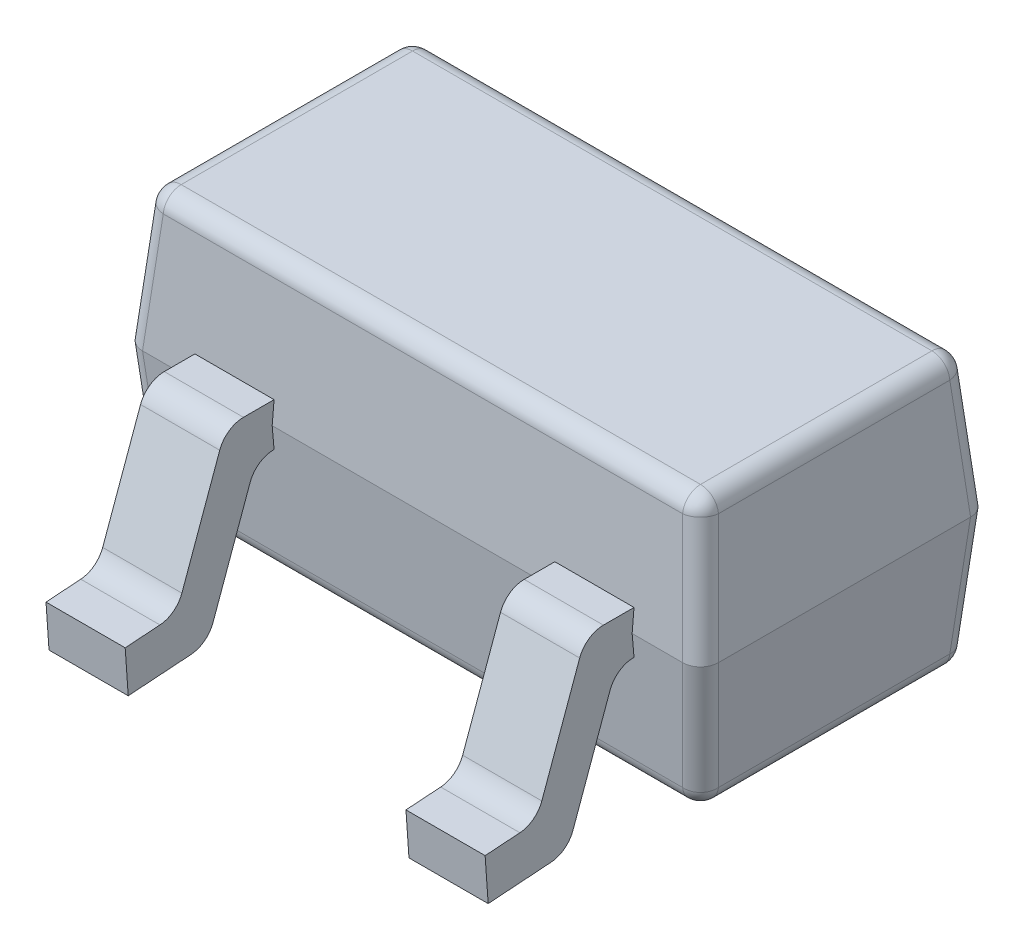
ISO-10303-21;
HEADER;
FILE_DESCRIPTION(('STEP AP214'),'2;1');
FILE_NAME('part.step','',(''),(''),'','','');
FILE_SCHEMA(('AUTOMOTIVE_DESIGN { 1 0 10303 214 1 1 1 1 }'));
ENDSEC;
DATA;
#1=APPLICATION_CONTEXT('core data for automotive mechanical design processes');
#2=APPLICATION_PROTOCOL_DEFINITION('international standard','automotive_design',2000,#1);
#3=PRODUCT_CONTEXT('',#1,'mechanical');
#4=PRODUCT('Part','Part','',(#3));
#5=PRODUCT_RELATED_PRODUCT_CATEGORY('part','',(#4));
#6=PRODUCT_DEFINITION_FORMATION('','',#4);
#7=PRODUCT_DEFINITION_CONTEXT('part definition',#1,'design');
#8=PRODUCT_DEFINITION('design','',#6,#7);
#9=PRODUCT_DEFINITION_SHAPE('','',#8);
#10=(LENGTH_UNIT() NAMED_UNIT(*) SI_UNIT(.MILLI.,.METRE.));
#11=(NAMED_UNIT(*) PLANE_ANGLE_UNIT() SI_UNIT($,.RADIAN.));
#12=(NAMED_UNIT(*) SI_UNIT($,.STERADIAN.) SOLID_ANGLE_UNIT());
#13=UNCERTAINTY_MEASURE_WITH_UNIT(LENGTH_MEASURE(1.E-05),#10,'distance_accuracy_value','');
#14=(GEOMETRIC_REPRESENTATION_CONTEXT(3) GLOBAL_UNCERTAINTY_ASSIGNED_CONTEXT((#13)) GLOBAL_UNIT_ASSIGNED_CONTEXT((#10,
#11,#12)) REPRESENTATION_CONTEXT('',''));
#15=CARTESIAN_POINT('',(0.,0.,0.));
#16=DIRECTION('',(0.,0.,1.));
#17=DIRECTION('',(1.,0.,0.));
#18=AXIS2_PLACEMENT_3D('',#15,#16,#17);
#19=CARTESIAN_POINT('',(0.8,0.45,0.4));
#20=DIRECTION('',(0.996194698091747,-0.0871557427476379,0.));
#21=DIRECTION('',(0.0871557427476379,0.996194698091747,0.));
#22=AXIS2_PLACEMENT_3D('',#19,#20,#21);
#23=PLANE('',#22);
#24=DIRECTION('',(0.,0.,-1.));
#25=VECTOR('',#24,1.);
#26=CARTESIAN_POINT('',(0.771184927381,0.120642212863,0.4));
#27=LINE('',#26,#25);
#28=CARTESIAN_POINT('',(0.771184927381,0.120642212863,0.321375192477));
#29=VERTEX_POINT('',#28);
#30=CARTESIAN_POINT('',(0.771184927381,0.120642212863,-0.321375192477));
#31=VERTEX_POINT('',#30);
#32=EDGE_CURVE('E11',#29,#31,#27,.T.);
#33=ORIENTED_EDGE('',*,*,#32,.T.);
#34=DIRECTION('',(0.0868265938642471,0.992432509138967,-0.0868265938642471));
#35=VECTOR('',#34,1.);
#36=CARTESIAN_POINT('',(0.794344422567,0.385356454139,-0.344534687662));
#37=LINE('',#36,#35);
#38=CARTESIAN_POINT('',(0.8,0.45,-0.350190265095));
#39=VERTEX_POINT('',#38);
#40=EDGE_CURVE('E25',#31,#39,#37,.T.);
#41=ORIENTED_EDGE('',*,*,#40,.T.);
#42=DIRECTION('',(0.,0.,-1.));
#43=VECTOR('',#42,1.);
#44=CARTESIAN_POINT('',(0.8,0.45,0.4));
#45=LINE('',#44,#43);
#46=CARTESIAN_POINT('',(0.8,0.45,0.350190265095));
#47=VERTEX_POINT('',#46);
#48=EDGE_CURVE('E1186',#47,#39,#45,.T.);
#49=ORIENTED_EDGE('',*,*,#48,.F.);
#50=DIRECTION('',(-0.0868265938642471,-0.992432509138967,-0.0868265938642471));
#51=VECTOR('',#50,1.);
#52=CARTESIAN_POINT('',(0.800375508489,0.454292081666,0.350565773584));
#53=LINE('',#52,#51);
#54=EDGE_CURVE('E1184',#47,#29,#53,.T.);
#55=ORIENTED_EDGE('',*,*,#54,.T.);
#56=EDGE_LOOP('',(#33,#41,#49,#55));
#57=FACE_BOUND('',#56,.T.);
#58=ADVANCED_FACE('F17',(#57),#23,.T.);
#59=CARTESIAN_POINT('',(0.738503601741,0.320778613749,0.338503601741));
#60=DIRECTION('',(0.0868265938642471,0.992432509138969,0.0868265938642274));
#61=DIRECTION('',(-0.701755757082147,0.122791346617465,-0.701755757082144));
#62=AXIS2_PLACEMENT_3D('',#59,#60,#61);
#63=CYLINDRICAL_SURFACE('',#62,0.05);
#64=CARTESIAN_POINT('',(0.800000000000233,0.44999999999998,0.350190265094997));
#65=CARTESIAN_POINT('',(0.800000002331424,0.449999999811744,0.350684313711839));
#66=CARTESIAN_POINT('',(0.799992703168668,0.449999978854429,0.351178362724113));
#67=CARTESIAN_POINT('',(0.799963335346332,0.449999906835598,0.352171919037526));
#68=CARTESIAN_POINT('',(0.799941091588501,0.44999985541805,0.352671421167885));
#69=CARTESIAN_POINT('',(0.799881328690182,0.449999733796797,0.353675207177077));
#70=CARTESIAN_POINT('',(0.799843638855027,0.449999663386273,0.354179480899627));
#71=CARTESIAN_POINT('',(0.799752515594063,0.449999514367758,0.355192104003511));
#72=CARTESIAN_POINT('',(0.79969891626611,0.449999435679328,0.355700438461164));
#73=CARTESIAN_POINT('',(0.799575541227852,0.449999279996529,0.356720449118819));
#74=CARTESIAN_POINT('',(0.799505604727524,0.449999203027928,0.357232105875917));
#75=CARTESIAN_POINT('',(0.799349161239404,0.449999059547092,0.358258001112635));
#76=CARTESIAN_POINT('',(0.799262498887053,0.44999899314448,0.358772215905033));
#77=CARTESIAN_POINT('',(0.799072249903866,0.449998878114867,0.359802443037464));
#78=CARTESIAN_POINT('',(0.798968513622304,0.449998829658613,0.360318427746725));
#79=CARTESIAN_POINT('',(0.798743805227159,0.449998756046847,0.36135138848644));
#80=CARTESIAN_POINT('',(0.798622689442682,0.449998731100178,0.361868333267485));
#81=CARTESIAN_POINT('',(0.798362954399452,0.449998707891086,0.362902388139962));
#82=CARTESIAN_POINT('',(0.798224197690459,0.449998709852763,0.363419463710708));
#83=CARTESIAN_POINT('',(0.797928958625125,0.449998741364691,0.364452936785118));
#84=CARTESIAN_POINT('',(0.797772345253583,0.449998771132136,0.364969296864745));
#85=CARTESIAN_POINT('',(0.797441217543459,0.44999885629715,0.366000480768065));
#86=CARTESIAN_POINT('',(0.797266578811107,0.449998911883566,0.366515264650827));
#87=CARTESIAN_POINT('',(0.79689927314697,0.449999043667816,0.367542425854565));
#88=CARTESIAN_POINT('',(0.796706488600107,0.449999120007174,0.368054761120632));
#89=CARTESIAN_POINT('',(0.796302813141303,0.449999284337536,0.369076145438));
#90=CARTESIAN_POINT('',(0.796091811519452,0.449999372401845,0.369585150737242));
#91=CARTESIAN_POINT('',(0.795651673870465,0.449999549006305,0.370598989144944));
#92=CARTESIAN_POINT('',(0.795422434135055,0.449999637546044,0.371103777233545));
#93=CARTESIAN_POINT('',(0.794945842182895,0.449999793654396,0.372108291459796));
#94=CARTESIAN_POINT('',(0.794698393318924,0.449999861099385,0.372607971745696));
#95=CARTESIAN_POINT('',(0.794185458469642,0.449999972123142,0.373601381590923));
#96=CARTESIAN_POINT('',(0.793919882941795,0.450000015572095,0.374095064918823));
#97=CARTESIAN_POINT('',(0.793370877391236,0.449999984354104,0.375075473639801));
#98=CARTESIAN_POINT('',(0.793087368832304,0.449999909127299,0.375562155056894));
#99=CARTESIAN_POINT('',(0.792502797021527,0.449999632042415,0.37652750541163));
#100=CARTESIAN_POINT('',(0.792201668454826,0.449999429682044,0.377006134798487));
#101=CARTESIAN_POINT('',(0.791582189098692,0.449998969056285,0.377954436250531));
#102=CARTESIAN_POINT('',(0.791263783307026,0.449998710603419,0.378424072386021));
#103=CARTESIAN_POINT('',(0.790610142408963,0.449998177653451,0.379353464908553));
#104=CARTESIAN_POINT('',(0.790274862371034,0.449997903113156,0.379813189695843));
#105=CARTESIAN_POINT('',(0.789587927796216,0.44999737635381,0.380721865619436));
#106=CARTESIAN_POINT('',(0.789236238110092,0.449997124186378,0.38117079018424));
#107=CARTESIAN_POINT('',(0.788516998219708,0.449996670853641,0.382057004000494));
#108=CARTESIAN_POINT('',(0.788149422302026,0.449996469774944,0.382494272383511));
#109=CARTESIAN_POINT('',(0.787398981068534,0.449996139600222,0.383356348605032));
#110=CARTESIAN_POINT('',(0.787016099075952,0.449996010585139,0.383781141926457));
#111=CARTESIAN_POINT('',(0.786235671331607,0.449995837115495,0.384617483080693));
#112=CARTESIAN_POINT('',(0.785838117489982,0.449995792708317,0.385029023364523));
#113=CARTESIAN_POINT('',(0.785029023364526,0.449995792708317,0.385838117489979));
#114=CARTESIAN_POINT('',(0.784617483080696,0.449995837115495,0.386235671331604));
#115=CARTESIAN_POINT('',(0.78378114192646,0.449996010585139,0.38701609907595));
#116=CARTESIAN_POINT('',(0.783356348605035,0.449996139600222,0.387398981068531));
#117=CARTESIAN_POINT('',(0.782494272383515,0.449996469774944,0.388149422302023));
#118=CARTESIAN_POINT('',(0.782057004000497,0.449996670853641,0.388516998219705));
#119=CARTESIAN_POINT('',(0.781170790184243,0.449997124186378,0.389236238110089));
#120=CARTESIAN_POINT('',(0.780721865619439,0.44999737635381,0.389587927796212));
#121=CARTESIAN_POINT('',(0.779813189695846,0.449997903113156,0.390274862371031));
#122=CARTESIAN_POINT('',(0.779353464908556,0.449998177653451,0.39061014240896));
#123=CARTESIAN_POINT('',(0.778424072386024,0.449998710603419,0.391263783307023));
#124=CARTESIAN_POINT('',(0.777954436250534,0.449998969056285,0.391582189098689));
#125=CARTESIAN_POINT('',(0.77700613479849,0.449999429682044,0.392201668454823));
#126=CARTESIAN_POINT('',(0.776527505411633,0.449999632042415,0.392502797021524));
#127=CARTESIAN_POINT('',(0.775562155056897,0.449999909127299,0.393087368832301));
#128=CARTESIAN_POINT('',(0.775075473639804,0.449999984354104,0.393370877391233));
#129=CARTESIAN_POINT('',(0.774095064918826,0.450000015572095,0.393919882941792));
#130=CARTESIAN_POINT('',(0.773601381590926,0.449999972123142,0.394185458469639));
#131=CARTESIAN_POINT('',(0.772607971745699,0.449999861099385,0.394698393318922));
#132=CARTESIAN_POINT('',(0.772108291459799,0.449999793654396,0.394945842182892));
#133=CARTESIAN_POINT('',(0.771103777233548,0.449999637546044,0.395422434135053));
#134=CARTESIAN_POINT('',(0.770598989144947,0.449999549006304,0.395651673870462));
#135=CARTESIAN_POINT('',(0.769585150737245,0.449999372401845,0.396091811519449));
#136=CARTESIAN_POINT('',(0.769076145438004,0.449999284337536,0.3963028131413));
#137=CARTESIAN_POINT('',(0.768054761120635,0.449999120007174,0.396706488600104));
#138=CARTESIAN_POINT('',(0.767542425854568,0.449999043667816,0.396899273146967));
#139=CARTESIAN_POINT('',(0.76651526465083,0.449998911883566,0.397266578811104));
#140=CARTESIAN_POINT('',(0.766000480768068,0.44999885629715,0.397441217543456));
#141=CARTESIAN_POINT('',(0.764969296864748,0.449998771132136,0.39777234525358));
#142=CARTESIAN_POINT('',(0.764452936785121,0.449998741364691,0.397928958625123));
#143=CARTESIAN_POINT('',(0.763419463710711,0.449998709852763,0.398224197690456));
#144=CARTESIAN_POINT('',(0.762902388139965,0.449998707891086,0.39836295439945));
#145=CARTESIAN_POINT('',(0.761868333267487,0.449998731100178,0.398622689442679));
#146=CARTESIAN_POINT('',(0.761351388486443,0.449998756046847,0.398743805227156));
#147=CARTESIAN_POINT('',(0.760318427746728,0.449998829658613,0.398968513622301));
#148=CARTESIAN_POINT('',(0.759802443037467,0.449998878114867,0.399072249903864));
#149=CARTESIAN_POINT('',(0.758772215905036,0.449998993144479,0.399262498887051));
#150=CARTESIAN_POINT('',(0.758258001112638,0.449999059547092,0.399349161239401));
#151=CARTESIAN_POINT('',(0.75723210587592,0.449999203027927,0.399505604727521));
#152=CARTESIAN_POINT('',(0.756720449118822,0.449999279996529,0.399575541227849));
#153=CARTESIAN_POINT('',(0.755700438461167,0.449999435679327,0.399698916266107));
#154=CARTESIAN_POINT('',(0.755192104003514,0.449999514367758,0.39975251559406));
#155=CARTESIAN_POINT('',(0.75417948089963,0.449999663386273,0.399843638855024));
#156=CARTESIAN_POINT('',(0.75367520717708,0.449999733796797,0.399881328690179));
#157=CARTESIAN_POINT('',(0.752671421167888,0.44999985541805,0.399941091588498));
#158=CARTESIAN_POINT('',(0.752171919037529,0.449999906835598,0.39996333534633));
#159=CARTESIAN_POINT('',(0.751178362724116,0.449999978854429,0.399992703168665));
#160=CARTESIAN_POINT('',(0.750684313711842,0.449999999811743,0.400000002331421));
#161=CARTESIAN_POINT('',(0.750190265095,0.44999999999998,0.40000000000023));
#162=B_SPLINE_CURVE_WITH_KNOTS('',3,(#64,#65,#66,#67,#68,#69,#70,#71,#72,#73,#74,#75,#76,#77,
#78,#79,#80,#81,#82,#83,#84,#85,#86,#87,#88,#89,#90,#91,#92,#93,#94,#95,#96,#97,#98,#99,#100,
#101,#102,#103,#104,#105,#106,#107,#108,#109,#110,#111,#112,#113,#114,#115,#116,#117,#118,#119,
#120,#121,#122,#123,#124,#125,#126,#127,#128,#129,#130,#131,#132,#133,#134,#135,#136,#137,#138,
#139,#140,#141,#142,#143,#144,#145,#146,#147,#148,#149,#150,#151,#152,#153,#154,#155,#156,#157,
#158,#159,#160,#161),.UNSPECIFIED.,.F.,.F.,(4,2,2,2,2,2,2,2,2,2,2,2,2,2,2,2,2,2,2,2,2,2,2,2,2,2,
2,2,2,2,2,2,2,2,2,2,2,2,2,2,2,2,2,2,2,2,2,2,4),(0.,0.00148209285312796,0.00298186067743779,
0.00449866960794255,0.00603188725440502,0.00758088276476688,0.00914502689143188,
0.0107236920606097,0.0123162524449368,0.0139220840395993,0.0155405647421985,0.0171710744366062,
0.018812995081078,0.0204657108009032,0.0221286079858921,0.0238010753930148,0.025482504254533,
0.0271718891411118,0.0288679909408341,0.0305698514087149,0.0322765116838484,0.0339870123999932,
0.0357003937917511,0.0374156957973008,0.0391319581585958,0.0408482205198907,0.0425635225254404,
0.0442769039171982,0.0459874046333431,0.0476940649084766,0.0493959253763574,0.0510920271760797,
0.0527814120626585,0.0544628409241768,0.0561353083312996,0.0577982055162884,0.0594509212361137,
0.0610928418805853,0.0627233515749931,0.0643418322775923,0.0659476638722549,0.0675402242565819,
0.0691188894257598,0.0706830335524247,0.0722320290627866,0.0737652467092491,0.0752820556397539,
0.0767818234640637,0.0782639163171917),.UNSPECIFIED.);
#163=CARTESIAN_POINT('',(0.750190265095,0.45,0.4));
#164=VERTEX_POINT('',#163);
#165=EDGE_CURVE('E1182',#47,#164,#162,.T.);
#166=ORIENTED_EDGE('',*,*,#165,.T.);
#167=DIRECTION('',(0.0868265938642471,0.992432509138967,0.0868265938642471));
#168=VECTOR('',#167,1.);
#169=CARTESIAN_POINT('',(0.738503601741,0.316420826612,0.388313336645));
#170=LINE('',#169,#168);
#171=CARTESIAN_POINT('',(0.721375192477,0.120642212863,0.371184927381));
#172=VERTEX_POINT('',#171);
#173=EDGE_CURVE('E1203',#172,#164,#170,.T.);
#174=ORIENTED_EDGE('',*,*,#173,.F.);
#175=CARTESIAN_POINT('',(0.721375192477,0.125,0.321375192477));
#176=DIRECTION('',(-0.0868265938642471,-0.992432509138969,-0.0868265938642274));
#177=DIRECTION('',(0.,0.0871557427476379,-0.996194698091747));
#178=AXIS2_PLACEMENT_3D('',#175,#176,#177);
#179=CIRCLE('',#178,0.05);
#180=EDGE_CURVE('E1200',#29,#172,#179,.T.);
#181=ORIENTED_EDGE('',*,*,#180,.F.);
#182=ORIENTED_EDGE('',*,*,#54,.F.);
#183=EDGE_LOOP('',(#166,#174,#181,#182));
#184=FACE_BOUND('',#183,.T.);
#185=ADVANCED_FACE('F1163',(#184),#63,.T.);
#186=CARTESIAN_POINT('',(0.721375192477,0.125,0.321375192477));
#187=DIRECTION('',(0.562101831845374,0.825342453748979,0.0533981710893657));
#188=DIRECTION('',(-0.586662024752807,0.443391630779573,-0.677666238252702));
#189=AXIS2_PLACEMENT_3D('',#186,#187,#188);
#190=SPHERICAL_SURFACE('',#189,0.05);
#191=CARTESIAN_POINT('',(0.721375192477,0.125,0.321375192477));
#192=DIRECTION('',(0.,0.,-1.));
#193=DIRECTION('',(1.,0.,0.));
#194=AXIS2_PLACEMENT_3D('',#191,#192,#193);
#195=CIRCLE('',#194,0.05);
#196=CARTESIAN_POINT('',(0.721375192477,0.075,0.321375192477));
#197=VERTEX_POINT('',#196);
#198=EDGE_CURVE('E1205',#29,#197,#195,.T.);
#199=ORIENTED_EDGE('',*,*,#198,.F.);
#200=ORIENTED_EDGE('',*,*,#180,.T.);
#201=CARTESIAN_POINT('',(0.721375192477,0.125,0.321375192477));
#202=DIRECTION('',(1.,0.,0.));
#203=DIRECTION('',(0.,1.,0.));
#204=AXIS2_PLACEMENT_3D('',#201,#202,#203);
#205=CIRCLE('',#204,0.05);
#206=EDGE_CURVE('E1209',#172,#197,#205,.T.);
#207=ORIENTED_EDGE('',*,*,#206,.T.);
#208=EDGE_LOOP('',(#199,#200,#207));
#209=FACE_BOUND('',#208,.T.);
#210=ADVANCED_FACE('F1160',(#209),#190,.T.);
#211=CARTESIAN_POINT('',(-0.8,0.125,0.321375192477));
#212=DIRECTION('',(1.,0.,0.));
#213=DIRECTION('',(0.,0.73727733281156,-0.675590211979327));
#214=AXIS2_PLACEMENT_3D('',#211,#212,#213);
#215=CYLINDRICAL_SURFACE('',#214,0.05);
#216=ORIENTED_EDGE('',*,*,#206,.F.);
#217=DIRECTION('',(1.,0.,0.));
#218=VECTOR('',#217,1.);
#219=CARTESIAN_POINT('',(-0.8,0.120642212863,0.371184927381));
#220=LINE('',#219,#218);
#221=CARTESIAN_POINT('',(-0.721375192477,0.120642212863,0.371184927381));
#222=VERTEX_POINT('',#221);
#223=EDGE_CURVE('E1300',#222,#172,#220,.T.);
#224=ORIENTED_EDGE('',*,*,#223,.F.);
#225=CARTESIAN_POINT('',(-0.721375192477,0.125,0.321375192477));
#226=DIRECTION('',(-1.,0.,0.));
#227=DIRECTION('',(0.,0.,1.));
#228=AXIS2_PLACEMENT_3D('',#225,#226,#227);
#229=CIRCLE('',#228,0.05);
#230=CARTESIAN_POINT('',(-0.721375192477,0.075,0.321375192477));
#231=VERTEX_POINT('',#230);
#232=EDGE_CURVE('E1312',#231,#222,#229,.T.);
#233=ORIENTED_EDGE('',*,*,#232,.F.);
#234=DIRECTION('',(-1.,0.,0.));
#235=VECTOR('',#234,1.);
#236=CARTESIAN_POINT('',(0.,0.075,0.321375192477));
#237=LINE('',#236,#235);
#238=EDGE_CURVE('E1317',#197,#231,#237,.T.);
#239=ORIENTED_EDGE('',*,*,#238,.F.);
#240=EDGE_LOOP('',(#216,#224,#233,#239));
#241=FACE_BOUND('',#240,.T.);
#242=ADVANCED_FACE('F1156',(#241),#215,.T.);
#243=CARTESIAN_POINT('',(0.,0.075,0.));
#244=DIRECTION('',(0.,-1.,0.));
#245=DIRECTION('',(0.,0.,-1.));
#246=AXIS2_PLACEMENT_3D('',#243,#244,#245);
#247=PLANE('',#246);
#248=DIRECTION('',(0.,0.,-1.));
#249=VECTOR('',#248,1.);
#250=CARTESIAN_POINT('',(-0.721375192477,0.075,0.));
#251=LINE('',#250,#249);
#252=CARTESIAN_POINT('',(-0.721375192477,0.075,-0.321375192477));
#253=VERTEX_POINT('',#252);
#254=EDGE_CURVE('E1322',#231,#253,#251,.T.);
#255=ORIENTED_EDGE('',*,*,#254,.T.);
#256=DIRECTION('',(1.,0.,0.));
#257=VECTOR('',#256,1.);
#258=CARTESIAN_POINT('',(0.,0.075,-0.321375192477));
#259=LINE('',#258,#257);
#260=CARTESIAN_POINT('',(0.721375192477,0.075,-0.321375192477));
#261=VERTEX_POINT('',#260);
#262=EDGE_CURVE('E1326',#253,#261,#259,.T.);
#263=ORIENTED_EDGE('',*,*,#262,.T.);
#264=DIRECTION('',(0.,0.,1.));
#265=VECTOR('',#264,1.);
#266=CARTESIAN_POINT('',(0.721375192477,0.075,0.));
#267=LINE('',#266,#265);
#268=EDGE_CURVE('E1217',#261,#197,#267,.T.);
#269=ORIENTED_EDGE('',*,*,#268,.T.);
#270=ORIENTED_EDGE('',*,*,#238,.T.);
#271=EDGE_LOOP('',(#255,#263,#269,#270));
#272=FACE_BOUND('',#271,.T.);
#273=ADVANCED_FACE('F1152',(#272),#247,.T.);
#274=CARTESIAN_POINT('',(0.721375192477,0.125,0.4));
#275=DIRECTION('',(0.,0.,-1.));
#276=DIRECTION('',(-0.675590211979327,0.73727733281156,0.));
#277=AXIS2_PLACEMENT_3D('',#274,#275,#276);
#278=CYLINDRICAL_SURFACE('',#277,0.05);
#279=ORIENTED_EDGE('',*,*,#198,.T.);
#280=ORIENTED_EDGE('',*,*,#268,.F.);
#281=CARTESIAN_POINT('',(0.721375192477,0.125,-0.321375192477));
#282=DIRECTION('',(0.,0.,-1.));
#283=DIRECTION('',(-1.,0.,0.));
#284=AXIS2_PLACEMENT_3D('',#281,#282,#283);
#285=CIRCLE('',#284,0.05);
#286=EDGE_CURVE('E1214',#31,#261,#285,.T.);
#287=ORIENTED_EDGE('',*,*,#286,.F.);
#288=ORIENTED_EDGE('',*,*,#32,.F.);
#289=EDGE_LOOP('',(#279,#280,#287,#288));
#290=FACE_BOUND('',#289,.T.);
#291=ADVANCED_FACE('F1148',(#290),#278,.T.);
#292=CARTESIAN_POINT('',(0.721375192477,0.125,-0.321375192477));
#293=DIRECTION('',(0.0533981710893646,0.825342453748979,-0.562101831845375));
#294=DIRECTION('',(-0.677666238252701,0.443391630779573,0.586662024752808));
#295=AXIS2_PLACEMENT_3D('',#292,#293,#294);
#296=SPHERICAL_SURFACE('',#295,0.05);
#297=CARTESIAN_POINT('',(0.721375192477,0.125,-0.321375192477));
#298=DIRECTION('',(-1.,0.,0.));
#299=DIRECTION('',(0.,0.,-1.));
#300=AXIS2_PLACEMENT_3D('',#297,#298,#299);
#301=CIRCLE('',#300,0.05);
#302=CARTESIAN_POINT('',(0.721375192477,0.120642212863,-0.371184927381));
#303=VERTEX_POINT('',#302);
#304=EDGE_CURVE('E1218',#303,#261,#301,.T.);
#305=ORIENTED_EDGE('',*,*,#304,.F.);
#306=CARTESIAN_POINT('',(0.721375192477,0.125,-0.321375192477));
#307=DIRECTION('',(-0.0868265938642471,-0.992432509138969,0.0868265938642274));
#308=DIRECTION('',(0.,-0.0871557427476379,-0.996194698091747));
#309=AXIS2_PLACEMENT_3D('',#306,#307,#308);
#310=CIRCLE('',#309,0.05);
#311=EDGE_CURVE('E1221',#303,#31,#310,.T.);
#312=ORIENTED_EDGE('',*,*,#311,.T.);
#313=ORIENTED_EDGE('',*,*,#286,.T.);
#314=EDGE_LOOP('',(#305,#312,#313));
#315=FACE_BOUND('',#314,.T.);
#316=ADVANCED_FACE('F1143',(#315),#296,.T.);
#317=CARTESIAN_POINT('',(0.744534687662,0.389714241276,-0.344534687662));
#318=DIRECTION('',(0.0868265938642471,0.992432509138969,-0.0868265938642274));
#319=DIRECTION('',(-0.701755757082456,0.122791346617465,0.701755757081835));
#320=AXIS2_PLACEMENT_3D('',#317,#318,#319);
#321=CYLINDRICAL_SURFACE('',#320,0.05);
#322=CARTESIAN_POINT('',(0.750190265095,0.450000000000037,-0.399999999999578));
#323=CARTESIAN_POINT('',(0.75068431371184,0.449999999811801,-0.400000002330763));
#324=CARTESIAN_POINT('',(0.751178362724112,0.449999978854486,-0.399992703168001));
#325=CARTESIAN_POINT('',(0.752171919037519,0.449999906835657,-0.399963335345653));
#326=CARTESIAN_POINT('',(0.752671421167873,0.449999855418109,-0.399941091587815));
#327=CARTESIAN_POINT('',(0.753675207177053,0.449999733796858,-0.399881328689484));
#328=CARTESIAN_POINT('',(0.754179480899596,0.449999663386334,-0.399843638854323));
#329=CARTESIAN_POINT('',(0.755192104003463,0.449999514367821,-0.399752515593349));
#330=CARTESIAN_POINT('',(0.755700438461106,0.449999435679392,-0.399698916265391));
#331=CARTESIAN_POINT('',(0.75672044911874,0.449999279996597,-0.399575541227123));
#332=CARTESIAN_POINT('',(0.757232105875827,0.449999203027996,-0.399505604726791));
#333=CARTESIAN_POINT('',(0.758258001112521,0.449999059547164,-0.399349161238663));
#334=CARTESIAN_POINT('',(0.758772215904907,0.449998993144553,-0.399262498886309));
#335=CARTESIAN_POINT('',(0.759802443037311,0.449998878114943,-0.399072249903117));
#336=CARTESIAN_POINT('',(0.76031842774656,0.449998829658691,-0.398968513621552));
#337=CARTESIAN_POINT('',(0.761351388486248,0.449998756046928,-0.398743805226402));
#338=CARTESIAN_POINT('',(0.761868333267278,0.44999873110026,-0.398622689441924));
#339=CARTESIAN_POINT('',(0.762902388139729,0.449998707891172,-0.398362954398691));
#340=CARTESIAN_POINT('',(0.763419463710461,0.44999870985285,-0.398224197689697));
#341=CARTESIAN_POINT('',(0.764452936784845,0.449998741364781,-0.397928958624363));
#342=CARTESIAN_POINT('',(0.764969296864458,0.449998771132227,-0.39777234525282));
#343=CARTESIAN_POINT('',(0.766000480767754,0.449998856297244,-0.397441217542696));
#344=CARTESIAN_POINT('',(0.766515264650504,0.449998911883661,-0.397266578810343));
#345=CARTESIAN_POINT('',(0.76754242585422,0.449999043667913,-0.396899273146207));
#346=CARTESIAN_POINT('',(0.768054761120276,0.449999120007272,-0.396706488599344));
#347=CARTESIAN_POINT('',(0.769076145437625,0.449999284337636,-0.396302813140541));
#348=CARTESIAN_POINT('',(0.769585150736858,0.449999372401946,-0.39609181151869));
#349=CARTESIAN_POINT('',(0.770598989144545,0.449999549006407,-0.395651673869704));
#350=CARTESIAN_POINT('',(0.77110377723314,0.449999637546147,-0.395422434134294));
#351=CARTESIAN_POINT('',(0.77210829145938,0.4499997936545,-0.394945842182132));
#352=CARTESIAN_POINT('',(0.772607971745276,0.449999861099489,-0.394698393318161));
#353=CARTESIAN_POINT('',(0.773601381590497,0.449999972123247,-0.394185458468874));
#354=CARTESIAN_POINT('',(0.774095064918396,0.4500000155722,-0.393919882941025));
#355=CARTESIAN_POINT('',(0.775075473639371,0.44999998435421,-0.393370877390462));
#356=CARTESIAN_POINT('',(0.775562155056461,0.449999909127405,-0.393087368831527));
#357=CARTESIAN_POINT('',(0.776527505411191,0.44999963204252,-0.392502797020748));
#358=CARTESIAN_POINT('',(0.777006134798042,0.44999942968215,-0.392201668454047));
#359=CARTESIAN_POINT('',(0.777954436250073,0.449998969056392,-0.391582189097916));
#360=CARTESIAN_POINT('',(0.778424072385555,0.449998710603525,-0.391263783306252));
#361=CARTESIAN_POINT('',(0.779353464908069,0.449998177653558,-0.390610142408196));
#362=CARTESIAN_POINT('',(0.779813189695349,0.449997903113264,-0.390274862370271));
#363=CARTESIAN_POINT('',(0.780721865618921,0.449997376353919,-0.389587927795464));
#364=CARTESIAN_POINT('',(0.781170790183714,0.449997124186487,-0.389236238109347));
#365=CARTESIAN_POINT('',(0.782057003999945,0.44999667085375,-0.388516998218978));
#366=CARTESIAN_POINT('',(0.78249427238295,0.449996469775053,-0.388149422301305));
#367=CARTESIAN_POINT('',(0.783356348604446,0.449996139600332,-0.387398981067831));
#368=CARTESIAN_POINT('',(0.783781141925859,0.449996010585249,-0.387016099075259));
#369=CARTESIAN_POINT('',(0.784617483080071,0.449995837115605,-0.386235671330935));
#370=CARTESIAN_POINT('',(0.785029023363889,0.449995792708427,-0.38583811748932));
#371=CARTESIAN_POINT('',(0.785838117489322,0.449995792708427,-0.385029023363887));
#372=CARTESIAN_POINT('',(0.786235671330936,0.449995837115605,-0.384617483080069));
#373=CARTESIAN_POINT('',(0.78701609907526,0.449996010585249,-0.383781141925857));
#374=CARTESIAN_POINT('',(0.787398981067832,0.449996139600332,-0.383356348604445));
#375=CARTESIAN_POINT('',(0.788149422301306,0.449996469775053,-0.382494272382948));
#376=CARTESIAN_POINT('',(0.788516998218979,0.44999667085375,-0.382057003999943));
#377=CARTESIAN_POINT('',(0.789236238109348,0.449997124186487,-0.381170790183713));
#378=CARTESIAN_POINT('',(0.789587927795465,0.449997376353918,-0.380721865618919));
#379=CARTESIAN_POINT('',(0.790274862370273,0.449997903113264,-0.379813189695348));
#380=CARTESIAN_POINT('',(0.790610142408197,0.449998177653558,-0.379353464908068));
#381=CARTESIAN_POINT('',(0.791263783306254,0.449998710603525,-0.378424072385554));
#382=CARTESIAN_POINT('',(0.791582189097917,0.449998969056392,-0.377954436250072));
#383=CARTESIAN_POINT('',(0.792201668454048,0.44999942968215,-0.37700613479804));
#384=CARTESIAN_POINT('',(0.79250279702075,0.44999963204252,-0.376527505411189));
#385=CARTESIAN_POINT('',(0.793087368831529,0.449999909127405,-0.37556215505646));
#386=CARTESIAN_POINT('',(0.793370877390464,0.449999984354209,-0.375075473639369));
#387=CARTESIAN_POINT('',(0.793919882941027,0.4500000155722,-0.374095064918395));
#388=CARTESIAN_POINT('',(0.794185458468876,0.449999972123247,-0.373601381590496));
#389=CARTESIAN_POINT('',(0.794698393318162,0.449999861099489,-0.372607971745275));
#390=CARTESIAN_POINT('',(0.794945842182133,0.4499997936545,-0.372108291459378));
#391=CARTESIAN_POINT('',(0.795422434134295,0.449999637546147,-0.371103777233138));
#392=CARTESIAN_POINT('',(0.795651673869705,0.449999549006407,-0.370598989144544));
#393=CARTESIAN_POINT('',(0.796091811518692,0.449999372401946,-0.369585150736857));
#394=CARTESIAN_POINT('',(0.796302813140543,0.449999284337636,-0.369076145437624));
#395=CARTESIAN_POINT('',(0.796706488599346,0.449999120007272,-0.368054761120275));
#396=CARTESIAN_POINT('',(0.796899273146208,0.449999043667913,-0.367542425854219));
#397=CARTESIAN_POINT('',(0.797266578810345,0.449998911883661,-0.366515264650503));
#398=CARTESIAN_POINT('',(0.797441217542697,0.449998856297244,-0.366000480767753));
#399=CARTESIAN_POINT('',(0.797772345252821,0.449998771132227,-0.364969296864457));
#400=CARTESIAN_POINT('',(0.797928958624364,0.449998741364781,-0.364452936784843));
#401=CARTESIAN_POINT('',(0.798224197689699,0.44999870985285,-0.36341946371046));
#402=CARTESIAN_POINT('',(0.798362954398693,0.449998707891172,-0.362902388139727));
#403=CARTESIAN_POINT('',(0.798622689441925,0.44999873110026,-0.361868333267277));
#404=CARTESIAN_POINT('',(0.798743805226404,0.449998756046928,-0.361351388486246));
#405=CARTESIAN_POINT('',(0.798968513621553,0.449998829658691,-0.360318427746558));
#406=CARTESIAN_POINT('',(0.799072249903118,0.449998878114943,-0.35980244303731));
#407=CARTESIAN_POINT('',(0.799262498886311,0.449998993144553,-0.358772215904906));
#408=CARTESIAN_POINT('',(0.799349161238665,0.449999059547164,-0.358258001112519));
#409=CARTESIAN_POINT('',(0.799505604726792,0.449999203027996,-0.357232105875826));
#410=CARTESIAN_POINT('',(0.799575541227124,0.449999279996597,-0.356720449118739));
#411=CARTESIAN_POINT('',(0.799698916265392,0.449999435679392,-0.355700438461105));
#412=CARTESIAN_POINT('',(0.79975251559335,0.449999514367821,-0.355192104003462));
#413=CARTESIAN_POINT('',(0.799843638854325,0.449999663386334,-0.354179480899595));
#414=CARTESIAN_POINT('',(0.799881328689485,0.449999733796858,-0.353675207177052));
#415=CARTESIAN_POINT('',(0.799941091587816,0.449999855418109,-0.352671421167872));
#416=CARTESIAN_POINT('',(0.799963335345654,0.449999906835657,-0.352171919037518));
#417=CARTESIAN_POINT('',(0.799992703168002,0.449999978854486,-0.351178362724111));
#418=CARTESIAN_POINT('',(0.800000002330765,0.449999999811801,-0.350684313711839));
#419=CARTESIAN_POINT('',(0.79999999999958,0.450000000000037,-0.350190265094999));
#420=B_SPLINE_CURVE_WITH_KNOTS('',3,(#322,#323,#324,#325,#326,#327,#328,#329,#330,#331,#332,
#333,#334,#335,#336,#337,#338,#339,#340,#341,#342,#343,#344,#345,#346,#347,#348,#349,#350,#351,
#352,#353,#354,#355,#356,#357,#358,#359,#360,#361,#362,#363,#364,#365,#366,#367,#368,#369,#370,
#371,#372,#373,#374,#375,#376,#377,#378,#379,#380,#381,#382,#383,#384,#385,#386,#387,#388,#389,
#390,#391,#392,#393,#394,#395,#396,#397,#398,#399,#400,#401,#402,#403,#404,#405,#406,#407,#408,
#409,#410,#411,#412,#413,#414,#415,#416,#417,#418,#419),.UNSPECIFIED.,.F.,.F.,(4,2,2,2,2,2,2,2,
2,2,2,2,2,2,2,2,2,2,2,2,2,2,2,2,2,2,2,2,2,2,2,2,2,2,2,2,2,2,2,2,2,2,2,2,2,2,2,2,4),(0.,
0.00148209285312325,0.00298186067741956,0.00449866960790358,0.00603188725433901,
0.00758088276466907,0.00914502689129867,0.010723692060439,0.0123162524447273,0.0139220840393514,
0.0155405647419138,0.0171710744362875,0.0188129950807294,0.0204657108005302,0.0221286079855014,
0.0238010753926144,0.0254825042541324,0.0271718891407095,0.0288679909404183,0.0305698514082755,
0.0322765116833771,0.0339870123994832,0.0357003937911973,0.0374156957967,0.0391319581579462,
0.0408482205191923,0.0425635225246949,0.044276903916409,0.0459874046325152,0.0476940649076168,
0.049395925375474,0.0510920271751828,0.0527814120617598,0.0544628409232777,0.0561353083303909,
0.057798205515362,0.0594509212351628,0.0610928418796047,0.0627233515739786,0.0643418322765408,
0.065947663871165,0.0675402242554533,0.0691188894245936,0.0706830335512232,0.0722320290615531,
0.0737652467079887,0.0752820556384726,0.0767818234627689,0.0782639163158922),.UNSPECIFIED.);
#421=CARTESIAN_POINT('',(0.750190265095,0.45,-0.4));
#422=VERTEX_POINT('',#421);
#423=EDGE_CURVE('E904',#422,#39,#420,.T.);
#424=ORIENTED_EDGE('',*,*,#423,.T.);
#425=ORIENTED_EDGE('',*,*,#40,.F.);
#426=ORIENTED_EDGE('',*,*,#311,.F.);
#427=DIRECTION('',(-0.0868265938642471,-0.992432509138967,0.0868265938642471));
#428=VECTOR('',#427,1.);
#429=CARTESIAN_POINT('',(0.738503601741,0.316420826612,-0.388313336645));
#430=LINE('',#429,#428);
#431=EDGE_CURVE('E1120',#422,#303,#430,.T.);
#432=ORIENTED_EDGE('',*,*,#431,.F.);
#433=EDGE_LOOP('',(#424,#425,#426,#432));
#434=FACE_BOUND('',#433,.T.);
#435=ADVANCED_FACE('F1132',(#434),#321,.T.);
#436=CARTESIAN_POINT('',(-0.8,0.45,-0.4));
#437=DIRECTION('',(0.,-0.0871557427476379,-0.996194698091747));
#438=DIRECTION('',(0.,0.996194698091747,-0.0871557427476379));
#439=AXIS2_PLACEMENT_3D('',#436,#437,#438);
#440=PLANE('',#439);
#441=DIRECTION('',(0.,0.996194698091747,-0.0871557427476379));
#442=VECTOR('',#441,1.);
#443=CARTESIAN_POINT('',(-0.11,0.45,-0.4));
#444=LINE('',#443,#442);
#445=CARTESIAN_POINT('',(-0.11,0.39,-0.394750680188));
#446=VERTEX_POINT('',#445);
#447=CARTESIAN_POINT('',(-0.11,0.45,-0.4));
#448=VERTEX_POINT('',#447);
#449=EDGE_CURVE('E1115',#446,#448,#444,.T.);
#450=ORIENTED_EDGE('',*,*,#449,.F.);
#451=DIRECTION('',(1.,0.,0.));
#452=VECTOR('',#451,1.);
#453=CARTESIAN_POINT('',(-0.11,0.39,-0.394750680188));
#454=LINE('',#453,#452);
#455=CARTESIAN_POINT('',(0.11,0.39,-0.394750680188));
#456=VERTEX_POINT('',#455);
#457=EDGE_CURVE('E1111',#446,#456,#454,.T.);
#458=ORIENTED_EDGE('',*,*,#457,.T.);
#459=DIRECTION('',(0.,0.996194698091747,-0.0871557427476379));
#460=VECTOR('',#459,1.);
#461=CARTESIAN_POINT('',(0.11,0.45,-0.4));
#462=LINE('',#461,#460);
#463=CARTESIAN_POINT('',(0.11,0.45,-0.4));
#464=VERTEX_POINT('',#463);
#465=EDGE_CURVE('E1107',#456,#464,#462,.T.);
#466=ORIENTED_EDGE('',*,*,#465,.T.);
#467=DIRECTION('',(-1.,0.,0.));
#468=VECTOR('',#467,1.);
#469=CARTESIAN_POINT('',(-0.8,0.45,-0.4));
#470=LINE('',#469,#468);
#471=EDGE_CURVE('E1102',#422,#464,#470,.T.);
#472=ORIENTED_EDGE('',*,*,#471,.F.);
#473=ORIENTED_EDGE('',*,*,#431,.T.);
#474=DIRECTION('',(-1.,0.,0.));
#475=VECTOR('',#474,1.);
#476=CARTESIAN_POINT('',(-0.8,0.120642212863,-0.371184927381));
#477=LINE('',#476,#475);
#478=CARTESIAN_POINT('',(-0.721375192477,0.120642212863,-0.371184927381));
#479=VERTEX_POINT('',#478);
#480=EDGE_CURVE('E1098',#303,#479,#477,.T.);
#481=ORIENTED_EDGE('',*,*,#480,.T.);
#482=DIRECTION('',(-0.0868265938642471,0.992432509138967,-0.0868265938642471));
#483=VECTOR('',#482,1.);
#484=CARTESIAN_POINT('',(-0.750565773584,0.454292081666,-0.400375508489));
#485=LINE('',#484,#483);
#486=CARTESIAN_POINT('',(-0.750190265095,0.45,-0.4));
#487=VERTEX_POINT('',#486);
#488=EDGE_CURVE('E1094',#479,#487,#485,.T.);
#489=ORIENTED_EDGE('',*,*,#488,.T.);
#490=DIRECTION('',(-1.,0.,0.));
#491=VECTOR('',#490,1.);
#492=CARTESIAN_POINT('',(-0.8,0.45,-0.4));
#493=LINE('',#492,#491);
#494=EDGE_CURVE('E1089',#448,#487,#493,.T.);
#495=ORIENTED_EDGE('',*,*,#494,.F.);
#496=EDGE_LOOP('',(#450,#458,#466,#472,#473,#481,#489,#495));
#497=FACE_BOUND('',#496,.T.);
#498=ADVANCED_FACE('F1142',(#497),#440,.T.);
#499=CARTESIAN_POINT('',(-0.8,0.45,-0.4));
#500=DIRECTION('',(0.,0.0871557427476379,-0.996194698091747));
#501=DIRECTION('',(0.,0.996194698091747,0.0871557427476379));
#502=AXIS2_PLACEMENT_3D('',#499,#500,#501);
#503=PLANE('',#502);
#504=DIRECTION('',(1.,0.,0.));
#505=VECTOR('',#504,1.);
#506=CARTESIAN_POINT('',(-0.11,0.51,-0.394750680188));
#507=LINE('',#506,#505);
#508=CARTESIAN_POINT('',(-0.11,0.51,-0.394750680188));
#509=VERTEX_POINT('',#508);
#510=CARTESIAN_POINT('',(0.11,0.51,-0.394750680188));
#511=VERTEX_POINT('',#510);
#512=EDGE_CURVE('E1084',#509,#511,#507,.T.);
#513=ORIENTED_EDGE('',*,*,#512,.F.);
#514=DIRECTION('',(0.,-0.996194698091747,-0.0871557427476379));
#515=VECTOR('',#514,1.);
#516=CARTESIAN_POINT('',(-0.11,0.45,-0.4));
#517=LINE('',#516,#515);
#518=EDGE_CURVE('E1079',#509,#448,#517,.T.);
#519=ORIENTED_EDGE('',*,*,#518,.T.);
#520=ORIENTED_EDGE('',*,*,#494,.T.);
#521=DIRECTION('',(0.0868265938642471,0.992432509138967,0.0868265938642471));
#522=VECTOR('',#521,1.);
#523=CARTESIAN_POINT('',(-0.750565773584,0.445707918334,-0.400375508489));
#524=LINE('',#523,#522);
#525=CARTESIAN_POINT('',(-0.721375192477,0.779357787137,-0.371184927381));
#526=VERTEX_POINT('',#525);
#527=EDGE_CURVE('E1075',#487,#526,#524,.T.);
#528=ORIENTED_EDGE('',*,*,#527,.T.);
#529=DIRECTION('',(1.,0.,0.));
#530=VECTOR('',#529,1.);
#531=CARTESIAN_POINT('',(-0.8,0.779357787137,-0.371184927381));
#532=LINE('',#531,#530);
#533=CARTESIAN_POINT('',(0.721375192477,0.779357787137,-0.371184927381));
#534=VERTEX_POINT('',#533);
#535=EDGE_CURVE('E1071',#526,#534,#532,.T.);
#536=ORIENTED_EDGE('',*,*,#535,.T.);
#537=DIRECTION('',(0.0868265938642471,-0.992432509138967,-0.0868265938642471));
#538=VECTOR('',#537,1.);
#539=CARTESIAN_POINT('',(0.738503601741,0.583579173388,-0.388313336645));
#540=LINE('',#539,#538);
#541=EDGE_CURVE('E1066',#534,#422,#540,.T.);
#542=ORIENTED_EDGE('',*,*,#541,.T.);
#543=ORIENTED_EDGE('',*,*,#471,.T.);
#544=DIRECTION('',(0.,-0.996194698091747,-0.0871557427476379));
#545=VECTOR('',#544,1.);
#546=CARTESIAN_POINT('',(0.11,0.45,-0.4));
#547=LINE('',#546,#545);
#548=EDGE_CURVE('E1061',#511,#464,#547,.T.);
#549=ORIENTED_EDGE('',*,*,#548,.F.);
#550=EDGE_LOOP('',(#513,#519,#520,#528,#536,#542,#543,#549));
#551=FACE_BOUND('',#550,.T.);
#552=ADVANCED_FACE('F1347',(#551),#503,.T.);
#553=CARTESIAN_POINT('',(0.11,0.,0.));
#554=DIRECTION('',(-1.,0.,0.));
#555=DIRECTION('',(0.,0.,1.));
#556=AXIS2_PLACEMENT_3D('',#553,#554,#555);
#557=PLANE('',#556);
#558=DIRECTION('',(0.,0.94057693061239,0.339580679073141));
#559=VECTOR('',#558,1.);
#560=CARTESIAN_POINT('',(0.11,0.01538389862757,-0.58));
#561=LINE('',#560,#559);
#562=CARTESIAN_POINT('',(0.11,0.05826269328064,-0.564519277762));
#563=VERTEX_POINT('',#562);
#564=CARTESIAN_POINT('',(0.11,0.343770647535,-0.461441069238));
#565=VERTEX_POINT('',#564);
#566=EDGE_CURVE('E1056',#563,#565,#561,.T.);
#567=ORIENTED_EDGE('',*,*,#566,.F.);
#568=CARTESIAN_POINT('',(0.11,0.08203334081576,-0.630359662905));
#569=DIRECTION('',(1.,0.,0.));
#570=DIRECTION('',(0.,-1.,0.));
#571=AXIS2_PLACEMENT_3D('',#568,#569,#570);
#572=CIRCLE('',#571,0.07);
#573=CARTESIAN_POINT('',(0.11,0.01220385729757,-0.625476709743));
#574=VERTEX_POINT('',#573);
#575=EDGE_CURVE('E1052',#563,#574,#572,.T.);
#576=ORIENTED_EDGE('',*,*,#575,.T.);
#577=DIRECTION('',(0.,0.0697564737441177,0.997564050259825));
#578=VECTOR('',#577,1.);
#579=CARTESIAN_POINT('',(0.11,0.,-0.8));
#580=LINE('',#579,#578);
#581=CARTESIAN_POINT('',(0.11,0.,-0.8));
#582=VERTEX_POINT('',#581);
#583=EDGE_CURVE('E1047',#582,#574,#580,.T.);
#584=ORIENTED_EDGE('',*,*,#583,.F.);
#585=DIRECTION('',(0.,-0.997564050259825,0.0697564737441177));
#586=VECTOR('',#585,1.);
#587=CARTESIAN_POINT('',(0.11,0.119707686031,-0.808370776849));
#588=LINE('',#587,#586);
#589=CARTESIAN_POINT('',(0.11,0.119707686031,-0.808370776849));
#590=VERTEX_POINT('',#589);
#591=EDGE_CURVE('E1042',#590,#582,#588,.T.);
#592=ORIENTED_EDGE('',*,*,#591,.F.);
#593=DIRECTION('',(0.,-0.0697564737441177,-0.997564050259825));
#594=VECTOR('',#593,1.);
#595=CARTESIAN_POINT('',(0.11,0.119707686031,-0.808370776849));
#596=LINE('',#595,#594);
#597=CARTESIAN_POINT('',(0.11,0.126460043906,-0.711807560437));
#598=VERTEX_POINT('',#597);
#599=EDGE_CURVE('E1037',#598,#590,#596,.T.);
#600=ORIENTED_EDGE('',*,*,#599,.F.);
#601=CARTESIAN_POINT('',(0.11,0.196289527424,-0.716690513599));
#602=DIRECTION('',(-1.,0.,0.));
#603=DIRECTION('',(0.,-1.,0.));
#604=AXIS2_PLACEMENT_3D('',#601,#602,#603);
#605=CIRCLE('',#604,0.07);
#606=CARTESIAN_POINT('',(0.11,0.172518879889,-0.650850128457));
#607=VERTEX_POINT('',#606);
#608=EDGE_CURVE('E1033',#598,#607,#605,.T.);
#609=ORIENTED_EDGE('',*,*,#608,.T.);
#610=DIRECTION('',(0.,-0.94057693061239,-0.339580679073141));
#611=VECTOR('',#610,1.);
#612=CARTESIAN_POINT('',(0.11,0.129640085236,-0.666330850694));
#613=LINE('',#612,#611);
#614=CARTESIAN_POINT('',(0.11,0.463770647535,-0.545698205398));
#615=VERTEX_POINT('',#614);
#616=EDGE_CURVE('E1028',#615,#607,#613,.T.);
#617=ORIENTED_EDGE('',*,*,#616,.F.);
#618=CARTESIAN_POINT('',(0.11,0.44,-0.479857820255));
#619=DIRECTION('',(1.,0.,0.));
#620=DIRECTION('',(0.,-1.,0.));
#621=AXIS2_PLACEMENT_3D('',#618,#619,#620);
#622=CIRCLE('',#621,0.07);
#623=CARTESIAN_POINT('',(0.11,0.51,-0.479857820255));
#624=VERTEX_POINT('',#623);
#625=EDGE_CURVE('E1024',#615,#624,#622,.T.);
#626=ORIENTED_EDGE('',*,*,#625,.T.);
#627=DIRECTION('',(0.,0.,-1.));
#628=VECTOR('',#627,1.);
#629=CARTESIAN_POINT('',(0.11,0.51,-0.529007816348));
#630=LINE('',#629,#628);
#631=EDGE_CURVE('E1019',#511,#624,#630,.T.);
#632=ORIENTED_EDGE('',*,*,#631,.F.);
#633=ORIENTED_EDGE('',*,*,#548,.T.);
#634=ORIENTED_EDGE('',*,*,#465,.F.);
#635=DIRECTION('',(0.,0.,1.));
#636=VECTOR('',#635,1.);
#637=CARTESIAN_POINT('',(0.11,0.39,-0.444750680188));
#638=LINE('',#637,#636);
#639=CARTESIAN_POINT('',(0.11,0.39,-0.395600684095));
#640=VERTEX_POINT('',#639);
#641=EDGE_CURVE('E1014',#640,#456,#638,.T.);
#642=ORIENTED_EDGE('',*,*,#641,.F.);
#643=CARTESIAN_POINT('',(0.11,0.32,-0.395600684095));
#644=DIRECTION('',(-1.,0.,0.));
#645=DIRECTION('',(0.,-1.,0.));
#646=AXIS2_PLACEMENT_3D('',#643,#644,#645);
#647=CIRCLE('',#646,0.07);
#648=EDGE_CURVE('E1010',#640,#565,#647,.T.);
#649=ORIENTED_EDGE('',*,*,#648,.T.);
#650=EDGE_LOOP('',(#567,#576,#584,#592,#600,#609,#617,#626,#632,#633,#634,#642,#649));
#651=FACE_BOUND('',#650,.T.);
#652=ADVANCED_FACE('F1428',(#651),#557,.F.);
#653=CARTESIAN_POINT('',(-0.11,0.32,-0.395600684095));
#654=DIRECTION('',(-1.,0.,0.));
#655=DIRECTION('',(0.,-0.818407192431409,0.574638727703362));
#656=AXIS2_PLACEMENT_3D('',#653,#654,#655);
#657=CYLINDRICAL_SURFACE('',#656,0.07);
#658=CARTESIAN_POINT('',(-0.11,0.32,-0.395600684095));
#659=DIRECTION('',(1.,0.,0.));
#660=DIRECTION('',(0.,-1.,0.));
#661=AXIS2_PLACEMENT_3D('',#658,#659,#660);
#662=CIRCLE('',#661,0.07);
#663=CARTESIAN_POINT('',(-0.11,0.343770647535,-0.461441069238));
#664=VERTEX_POINT('',#663);
#665=CARTESIAN_POINT('',(-0.11,0.39,-0.395600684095));
#666=VERTEX_POINT('',#665);
#667=EDGE_CURVE('E1005',#664,#666,#662,.T.);
#668=ORIENTED_EDGE('',*,*,#667,.F.);
#669=DIRECTION('',(-1.,0.,0.));
#670=VECTOR('',#669,1.);
#671=CARTESIAN_POINT('',(-0.11,0.343770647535,-0.461441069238));
#672=LINE('',#671,#670);
#673=EDGE_CURVE('E1000',#565,#664,#672,.T.);
#674=ORIENTED_EDGE('',*,*,#673,.F.);
#675=ORIENTED_EDGE('',*,*,#648,.F.);
#676=DIRECTION('',(1.,0.,0.));
#677=VECTOR('',#676,1.);
#678=CARTESIAN_POINT('',(0.11,0.39,-0.395600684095));
#679=LINE('',#678,#677);
#680=EDGE_CURVE('E995',#666,#640,#679,.T.);
#681=ORIENTED_EDGE('',*,*,#680,.F.);
#682=EDGE_LOOP('',(#668,#674,#675,#681));
#683=FACE_BOUND('',#682,.T.);
#684=ADVANCED_FACE('F1469',(#683),#657,.F.);
#685=CARTESIAN_POINT('',(-0.11,0.39,-0.444750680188));
#686=DIRECTION('',(0.,1.,0.));
#687=DIRECTION('',(-1.,0.,0.));
#688=AXIS2_PLACEMENT_3D('',#685,#686,#687);
#689=PLANE('',#688);
#690=DIRECTION('',(0.,0.,1.));
#691=VECTOR('',#690,1.);
#692=CARTESIAN_POINT('',(-0.11,0.39,-0.444750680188));
#693=LINE('',#692,#691);
#694=EDGE_CURVE('E990',#666,#446,#693,.T.);
#695=ORIENTED_EDGE('',*,*,#694,.F.);
#696=ORIENTED_EDGE('',*,*,#680,.T.);
#697=ORIENTED_EDGE('',*,*,#641,.T.);
#698=ORIENTED_EDGE('',*,*,#457,.F.);
#699=EDGE_LOOP('',(#695,#696,#697,#698));
#700=FACE_BOUND('',#699,.T.);
#701=ADVANCED_FACE('F1425',(#700),#689,.F.);
#702=CARTESIAN_POINT('',(-0.11,0.,0.));
#703=DIRECTION('',(-1.,0.,0.));
#704=DIRECTION('',(0.,0.,1.));
#705=AXIS2_PLACEMENT_3D('',#702,#703,#704);
#706=PLANE('',#705);
#707=DIRECTION('',(0.,0.0697564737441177,0.997564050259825));
#708=VECTOR('',#707,1.);
#709=CARTESIAN_POINT('',(-0.11,0.,-0.8));
#710=LINE('',#709,#708);
#711=CARTESIAN_POINT('',(-0.11,0.,-0.8));
#712=VERTEX_POINT('',#711);
#713=CARTESIAN_POINT('',(-0.11,0.01220385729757,-0.625476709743));
#714=VERTEX_POINT('',#713);
#715=EDGE_CURVE('E986',#712,#714,#710,.T.);
#716=ORIENTED_EDGE('',*,*,#715,.T.);
#717=CARTESIAN_POINT('',(-0.11,0.08203334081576,-0.630359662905));
#718=DIRECTION('',(-1.,0.,0.));
#719=DIRECTION('',(0.,-1.,0.));
#720=AXIS2_PLACEMENT_3D('',#717,#718,#719);
#721=CIRCLE('',#720,0.07);
#722=CARTESIAN_POINT('',(-0.11,0.05826269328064,-0.564519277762));
#723=VERTEX_POINT('',#722);
#724=EDGE_CURVE('E982',#714,#723,#721,.T.);
#725=ORIENTED_EDGE('',*,*,#724,.T.);
#726=DIRECTION('',(0.,0.94057693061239,0.339580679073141));
#727=VECTOR('',#726,1.);
#728=CARTESIAN_POINT('',(-0.11,0.01538389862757,-0.58));
#729=LINE('',#728,#727);
#730=EDGE_CURVE('E977',#723,#664,#729,.T.);
#731=ORIENTED_EDGE('',*,*,#730,.T.);
#732=ORIENTED_EDGE('',*,*,#667,.T.);
#733=ORIENTED_EDGE('',*,*,#694,.T.);
#734=ORIENTED_EDGE('',*,*,#449,.T.);
#735=ORIENTED_EDGE('',*,*,#518,.F.);
#736=DIRECTION('',(0.,0.,-1.));
#737=VECTOR('',#736,1.);
#738=CARTESIAN_POINT('',(-0.11,0.51,-0.529007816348));
#739=LINE('',#738,#737);
#740=CARTESIAN_POINT('',(-0.11,0.51,-0.479857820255));
#741=VERTEX_POINT('',#740);
#742=EDGE_CURVE('E973',#509,#741,#739,.T.);
#743=ORIENTED_EDGE('',*,*,#742,.T.);
#744=CARTESIAN_POINT('',(-0.11,0.44,-0.479857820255));
#745=DIRECTION('',(-1.,0.,0.));
#746=DIRECTION('',(0.,-1.,0.));
#747=AXIS2_PLACEMENT_3D('',#744,#745,#746);
#748=CIRCLE('',#747,0.07);
#749=CARTESIAN_POINT('',(-0.11,0.463770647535,-0.545698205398));
#750=VERTEX_POINT('',#749);
#751=EDGE_CURVE('E969',#741,#750,#748,.T.);
#752=ORIENTED_EDGE('',*,*,#751,.T.);
#753=DIRECTION('',(0.,-0.94057693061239,-0.339580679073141));
#754=VECTOR('',#753,1.);
#755=CARTESIAN_POINT('',(-0.11,0.129640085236,-0.666330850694));
#756=LINE('',#755,#754);
#757=CARTESIAN_POINT('',(-0.11,0.172518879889,-0.650850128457));
#758=VERTEX_POINT('',#757);
#759=EDGE_CURVE('E965',#750,#758,#756,.T.);
#760=ORIENTED_EDGE('',*,*,#759,.T.);
#761=CARTESIAN_POINT('',(-0.11,0.196289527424,-0.716690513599));
#762=DIRECTION('',(1.,0.,0.));
#763=DIRECTION('',(0.,-1.,0.));
#764=AXIS2_PLACEMENT_3D('',#761,#762,#763);
#765=CIRCLE('',#764,0.07);
#766=CARTESIAN_POINT('',(-0.11,0.126460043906,-0.711807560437));
#767=VERTEX_POINT('',#766);
#768=EDGE_CURVE('E961',#758,#767,#765,.T.);
#769=ORIENTED_EDGE('',*,*,#768,.T.);
#770=DIRECTION('',(0.,-0.0697564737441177,-0.997564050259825));
#771=VECTOR('',#770,1.);
#772=CARTESIAN_POINT('',(-0.11,0.119707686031,-0.808370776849));
#773=LINE('',#772,#771);
#774=CARTESIAN_POINT('',(-0.11,0.119707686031,-0.808370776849));
#775=VERTEX_POINT('',#774);
#776=EDGE_CURVE('E957',#767,#775,#773,.T.);
#777=ORIENTED_EDGE('',*,*,#776,.T.);
#778=DIRECTION('',(0.,-0.997564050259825,0.0697564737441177));
#779=VECTOR('',#778,1.);
#780=CARTESIAN_POINT('',(-0.11,0.119707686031,-0.808370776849));
#781=LINE('',#780,#779);
#782=EDGE_CURVE('E953',#775,#712,#781,.T.);
#783=ORIENTED_EDGE('',*,*,#782,.T.);
#784=EDGE_LOOP('',(#716,#725,#731,#732,#733,#734,#735,#743,#752,#760,#769,#777,#783));
#785=FACE_BOUND('',#784,.T.);
#786=ADVANCED_FACE('F1423',(#785),#706,.T.);
#787=CARTESIAN_POINT('',(-0.11,0.119707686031,-0.808370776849));
#788=DIRECTION('',(0.,0.0697564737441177,0.997564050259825));
#789=DIRECTION('',(0.,-0.997564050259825,0.0697564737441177));
#790=AXIS2_PLACEMENT_3D('',#787,#788,#789);
#791=PLANE('',#790);
#792=ORIENTED_EDGE('',*,*,#591,.T.);
#793=DIRECTION('',(1.,0.,0.));
#794=VECTOR('',#793,1.);
#795=CARTESIAN_POINT('',(-0.11,0.,-0.8));
#796=LINE('',#795,#794);
#797=EDGE_CURVE('E948',#712,#582,#796,.T.);
#798=ORIENTED_EDGE('',*,*,#797,.F.);
#799=ORIENTED_EDGE('',*,*,#782,.F.);
#800=DIRECTION('',(1.,0.,0.));
#801=VECTOR('',#800,1.);
#802=CARTESIAN_POINT('',(-0.11,0.119707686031,-0.808370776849));
#803=LINE('',#802,#801);
#804=EDGE_CURVE('E943',#775,#590,#803,.T.);
#805=ORIENTED_EDGE('',*,*,#804,.T.);
#806=EDGE_LOOP('',(#792,#798,#799,#805));
#807=FACE_BOUND('',#806,.T.);
#808=ADVANCED_FACE('F1455',(#807),#791,.F.);
#809=CARTESIAN_POINT('',(-0.11,0.119707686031,-0.808370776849));
#810=DIRECTION('',(0.,-0.997564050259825,0.0697564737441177));
#811=DIRECTION('',(0.,-0.0697564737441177,-0.997564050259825));
#812=AXIS2_PLACEMENT_3D('',#809,#810,#811);
#813=PLANE('',#812);
#814=ORIENTED_EDGE('',*,*,#776,.F.);
#815=DIRECTION('',(1.,0.,0.));
#816=VECTOR('',#815,1.);
#817=CARTESIAN_POINT('',(0.11,0.126460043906,-0.711807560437));
#818=LINE('',#817,#816);
#819=EDGE_CURVE('E938',#767,#598,#818,.T.);
#820=ORIENTED_EDGE('',*,*,#819,.T.);
#821=ORIENTED_EDGE('',*,*,#599,.T.);
#822=ORIENTED_EDGE('',*,*,#804,.F.);
#823=EDGE_LOOP('',(#814,#820,#821,#822));
#824=FACE_BOUND('',#823,.T.);
#825=ADVANCED_FACE('F1453',(#824),#813,.F.);
#826=CARTESIAN_POINT('',(-0.11,0.196289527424,-0.716690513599));
#827=DIRECTION('',(-1.,0.,0.));
#828=DIRECTION('',(0.,0.797854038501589,-0.602850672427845));
#829=AXIS2_PLACEMENT_3D('',#826,#827,#828);
#830=CYLINDRICAL_SURFACE('',#829,0.07);
#831=ORIENTED_EDGE('',*,*,#768,.F.);
#832=DIRECTION('',(-1.,0.,0.));
#833=VECTOR('',#832,1.);
#834=CARTESIAN_POINT('',(-0.11,0.172518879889,-0.650850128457));
#835=LINE('',#834,#833);
#836=EDGE_CURVE('E933',#607,#758,#835,.T.);
#837=ORIENTED_EDGE('',*,*,#836,.F.);
#838=ORIENTED_EDGE('',*,*,#608,.F.);
#839=ORIENTED_EDGE('',*,*,#819,.F.);
#840=EDGE_LOOP('',(#831,#837,#838,#839));
#841=FACE_BOUND('',#840,.T.);
#842=ADVANCED_FACE('F1448',(#841),#830,.F.);
#843=CARTESIAN_POINT('',(-0.11,0.129640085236,-0.666330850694));
#844=DIRECTION('',(0.,-0.339580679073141,0.94057693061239));
#845=DIRECTION('',(0.,-0.94057693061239,-0.339580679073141));
#846=AXIS2_PLACEMENT_3D('',#843,#844,#845);
#847=PLANE('',#846);
#848=ORIENTED_EDGE('',*,*,#616,.T.);
#849=ORIENTED_EDGE('',*,*,#836,.T.);
#850=ORIENTED_EDGE('',*,*,#759,.F.);
#851=DIRECTION('',(1.,0.,0.));
#852=VECTOR('',#851,1.);
#853=CARTESIAN_POINT('',(-0.11,0.463770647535,-0.545698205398));
#854=LINE('',#853,#852);
#855=EDGE_CURVE('E928',#750,#615,#854,.T.);
#856=ORIENTED_EDGE('',*,*,#855,.T.);
#857=EDGE_LOOP('',(#848,#849,#850,#856));
#858=FACE_BOUND('',#857,.T.);
#859=ADVANCED_FACE('F1442',(#858),#847,.F.);
#860=CARTESIAN_POINT('',(-0.11,0.44,-0.479857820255));
#861=DIRECTION('',(1.,0.,0.));
#862=DIRECTION('',(0.,-0.818407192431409,0.574638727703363));
#863=AXIS2_PLACEMENT_3D('',#860,#861,#862);
#864=CYLINDRICAL_SURFACE('',#863,0.07);
#865=ORIENTED_EDGE('',*,*,#751,.F.);
#866=DIRECTION('',(-1.,0.,0.));
#867=VECTOR('',#866,1.);
#868=CARTESIAN_POINT('',(-0.11,0.51,-0.479857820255));
#869=LINE('',#868,#867);
#870=EDGE_CURVE('E923',#624,#741,#869,.T.);
#871=ORIENTED_EDGE('',*,*,#870,.F.);
#872=ORIENTED_EDGE('',*,*,#625,.F.);
#873=ORIENTED_EDGE('',*,*,#855,.F.);
#874=EDGE_LOOP('',(#865,#871,#872,#873));
#875=FACE_BOUND('',#874,.T.);
#876=ADVANCED_FACE('F1439',(#875),#864,.T.);
#877=CARTESIAN_POINT('',(-0.11,0.51,-0.529007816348));
#878=DIRECTION('',(0.,-1.,0.));
#879=DIRECTION('',(1.,0.,0.));
#880=AXIS2_PLACEMENT_3D('',#877,#878,#879);
#881=PLANE('',#880);
#882=ORIENTED_EDGE('',*,*,#631,.T.);
#883=ORIENTED_EDGE('',*,*,#870,.T.);
#884=ORIENTED_EDGE('',*,*,#742,.F.);
#885=ORIENTED_EDGE('',*,*,#512,.T.);
#886=EDGE_LOOP('',(#882,#883,#884,#885));
#887=FACE_BOUND('',#886,.T.);
#888=ADVANCED_FACE('F1433',(#887),#881,.F.);
#889=CARTESIAN_POINT('',(-0.11,0.,-0.8));
#890=DIRECTION('',(0.,0.997564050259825,-0.0697564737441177));
#891=DIRECTION('',(0.,0.0697564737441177,0.997564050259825));
#892=AXIS2_PLACEMENT_3D('',#889,#890,#891);
#893=PLANE('',#892);
#894=ORIENTED_EDGE('',*,*,#583,.T.);
#895=DIRECTION('',(-1.,0.,0.));
#896=VECTOR('',#895,1.);
#897=CARTESIAN_POINT('',(-0.11,0.01220385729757,-0.625476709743));
#898=LINE('',#897,#896);
#899=EDGE_CURVE('E918',#574,#714,#898,.T.);
#900=ORIENTED_EDGE('',*,*,#899,.T.);
#901=ORIENTED_EDGE('',*,*,#715,.F.);
#902=ORIENTED_EDGE('',*,*,#797,.T.);
#903=EDGE_LOOP('',(#894,#900,#901,#902));
#904=FACE_BOUND('',#903,.T.);
#905=ADVANCED_FACE('F1462',(#904),#893,.F.);
#906=CARTESIAN_POINT('',(-0.11,0.08203334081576,-0.630359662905));
#907=DIRECTION('',(1.,0.,0.));
#908=DIRECTION('',(0.,0.797854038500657,-0.602850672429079));
#909=AXIS2_PLACEMENT_3D('',#906,#907,#908);
#910=CYLINDRICAL_SURFACE('',#909,0.07);
#911=ORIENTED_EDGE('',*,*,#724,.F.);
#912=ORIENTED_EDGE('',*,*,#899,.F.);
#913=ORIENTED_EDGE('',*,*,#575,.F.);
#914=DIRECTION('',(1.,0.,0.));
#915=VECTOR('',#914,1.);
#916=CARTESIAN_POINT('',(-0.11,0.05826269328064,-0.564519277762));
#917=LINE('',#916,#915);
#918=EDGE_CURVE('E913',#723,#563,#917,.T.);
#919=ORIENTED_EDGE('',*,*,#918,.F.);
#920=EDGE_LOOP('',(#911,#912,#913,#919));
#921=FACE_BOUND('',#920,.T.);
#922=ADVANCED_FACE('F1465',(#921),#910,.T.);
#923=CARTESIAN_POINT('',(-0.11,0.01538389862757,-0.58));
#924=DIRECTION('',(0.,0.339580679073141,-0.94057693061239));
#925=DIRECTION('',(0.,0.94057693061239,0.339580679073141));
#926=AXIS2_PLACEMENT_3D('',#923,#924,#925);
#927=PLANE('',#926);
#928=ORIENTED_EDGE('',*,*,#566,.T.);
#929=ORIENTED_EDGE('',*,*,#673,.T.);
#930=ORIENTED_EDGE('',*,*,#730,.F.);
#931=ORIENTED_EDGE('',*,*,#918,.T.);
#932=EDGE_LOOP('',(#928,#929,#930,#931));
#933=FACE_BOUND('',#932,.T.);
#934=ADVANCED_FACE('F885',(#933),#927,.F.);
#935=CARTESIAN_POINT('',(0.738503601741,0.579221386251,-0.338503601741));
#936=DIRECTION('',(0.0868265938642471,-0.992432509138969,-0.0868265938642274));
#937=DIRECTION('',(-0.701755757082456,-0.122791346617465,0.701755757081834));
#938=AXIS2_PLACEMENT_3D('',#935,#936,#937);
#939=CYLINDRICAL_SURFACE('',#938,0.05);
#940=CARTESIAN_POINT('',(0.721375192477,0.775,-0.321375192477));
#941=DIRECTION('',(0.0868265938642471,-0.992432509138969,-0.0868265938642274));
#942=DIRECTION('',(0.,-0.0871557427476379,0.996194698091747));
#943=AXIS2_PLACEMENT_3D('',#940,#941,#942);
#944=CIRCLE('',#943,0.05);
#945=CARTESIAN_POINT('',(0.771184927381,0.779357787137,-0.321375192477));
#946=VERTEX_POINT('',#945);
#947=EDGE_CURVE('E908',#534,#946,#944,.T.);
#948=ORIENTED_EDGE('',*,*,#947,.T.);
#949=DIRECTION('',(-0.0868265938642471,0.992432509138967,0.0868265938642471));
#950=VECTOR('',#949,1.);
#951=CARTESIAN_POINT('',(0.794344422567,0.514643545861,-0.344534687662));
#952=LINE('',#951,#950);
#953=EDGE_CURVE('E905',#39,#946,#952,.T.);
#954=ORIENTED_EDGE('',*,*,#953,.F.);
#955=ORIENTED_EDGE('',*,*,#423,.F.);
#956=ORIENTED_EDGE('',*,*,#541,.F.);
#957=EDGE_LOOP('',(#948,#954,#955,#956));
#958=FACE_BOUND('',#957,.T.);
#959=ADVANCED_FACE('F880',(#958),#939,.T.);
#960=CARTESIAN_POINT('',(0.8,0.45,0.4));
#961=DIRECTION('',(0.996194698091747,0.0871557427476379,0.));
#962=DIRECTION('',(-0.0871557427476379,0.996194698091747,0.));
#963=AXIS2_PLACEMENT_3D('',#960,#961,#962);
#964=PLANE('',#963);
#965=ORIENTED_EDGE('',*,*,#48,.T.);
#966=ORIENTED_EDGE('',*,*,#953,.T.);
#967=DIRECTION('',(0.,0.,1.));
#968=VECTOR('',#967,1.);
#969=CARTESIAN_POINT('',(0.771184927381,0.779357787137,0.4));
#970=LINE('',#969,#968);
#971=CARTESIAN_POINT('',(0.771184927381,0.779357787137,0.321375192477));
#972=VERTEX_POINT('',#971);
#973=EDGE_CURVE('E909',#946,#972,#970,.T.);
#974=ORIENTED_EDGE('',*,*,#973,.T.);
#975=DIRECTION('',(0.0868265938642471,-0.992432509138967,0.0868265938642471));
#976=VECTOR('',#975,1.);
#977=CARTESIAN_POINT('',(0.800375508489,0.445707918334,0.350565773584));
#978=LINE('',#977,#976);
#979=EDGE_CURVE('E1197',#972,#47,#978,.T.);
#980=ORIENTED_EDGE('',*,*,#979,.T.);
#981=EDGE_LOOP('',(#965,#966,#974,#980));
#982=FACE_BOUND('',#981,.T.);
#983=ADVANCED_FACE('F875',(#982),#964,.T.);
#984=CARTESIAN_POINT('',(0.750565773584,0.441350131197,0.350565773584));
#985=DIRECTION('',(0.0868265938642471,-0.992432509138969,0.0868265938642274));
#986=DIRECTION('',(-0.701755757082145,-0.122791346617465,-0.701755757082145));
#987=AXIS2_PLACEMENT_3D('',#984,#985,#986);
#988=CYLINDRICAL_SURFACE('',#987,0.05);
#989=CARTESIAN_POINT('',(0.721375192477,0.775,0.321375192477));
#990=DIRECTION('',(0.0868265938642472,-0.992432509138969,0.0868265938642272));
#991=DIRECTION('',(0.,0.0871557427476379,0.996194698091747));
#992=AXIS2_PLACEMENT_3D('',#989,#990,#991);
#993=CIRCLE('',#992,0.05);
#994=CARTESIAN_POINT('',(0.721375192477,0.779357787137,0.371184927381));
#995=VERTEX_POINT('',#994);
#996=EDGE_CURVE('E1240',#972,#995,#993,.T.);
#997=ORIENTED_EDGE('',*,*,#996,.T.);
#998=DIRECTION('',(-0.0868265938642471,0.992432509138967,-0.0868265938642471));
#999=VECTOR('',#998,1.);
#1000=CARTESIAN_POINT('',(0.738503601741,0.583579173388,0.388313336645));
#1001=LINE('',#1000,#999);
#1002=EDGE_CURVE('E855',#164,#995,#1001,.T.);
#1003=ORIENTED_EDGE('',*,*,#1002,.F.);
#1004=ORIENTED_EDGE('',*,*,#165,.F.);
#1005=ORIENTED_EDGE('',*,*,#979,.F.);
#1006=EDGE_LOOP('',(#997,#1003,#1004,#1005));
#1007=FACE_BOUND('',#1006,.T.);
#1008=ADVANCED_FACE('F864',(#1007),#988,.T.);
#1009=CARTESIAN_POINT('',(-0.8,0.45,0.4));
#1010=DIRECTION('',(0.,0.0871557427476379,0.996194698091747));
#1011=DIRECTION('',(0.,-0.996194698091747,0.0871557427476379));
#1012=AXIS2_PLACEMENT_3D('',#1009,#1010,#1011);
#1013=PLANE('',#1012);
#1014=DIRECTION('',(-1.,0.,0.));
#1015=VECTOR('',#1014,1.);
#1016=CARTESIAN_POINT('',(-0.39,0.51,0.394750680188));
#1017=LINE('',#1016,#1015);
#1018=CARTESIAN_POINT('',(-0.39,0.51,0.394750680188));
#1019=VERTEX_POINT('',#1018);
#1020=CARTESIAN_POINT('',(-0.61,0.51,0.394750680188));
#1021=VERTEX_POINT('',#1020);
#1022=EDGE_CURVE('E850',#1019,#1021,#1017,.T.);
#1023=ORIENTED_EDGE('',*,*,#1022,.F.);
#1024=DIRECTION('',(0.,-0.996194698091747,0.0871557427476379));
#1025=VECTOR('',#1024,1.);
#1026=CARTESIAN_POINT('',(-0.39,0.45,0.4));
#1027=LINE('',#1026,#1025);
#1028=CARTESIAN_POINT('',(-0.39,0.45,0.4));
#1029=VERTEX_POINT('',#1028);
#1030=EDGE_CURVE('E846',#1019,#1029,#1027,.T.);
#1031=ORIENTED_EDGE('',*,*,#1030,.T.);
#1032=DIRECTION('',(1.,0.,0.));
#1033=VECTOR('',#1032,1.);
#1034=CARTESIAN_POINT('',(-0.8,0.45,0.4));
#1035=LINE('',#1034,#1033);
#1036=CARTESIAN_POINT('',(0.39,0.45,0.4));
#1037=VERTEX_POINT('',#1036);
#1038=EDGE_CURVE('E842',#1029,#1037,#1035,.T.);
#1039=ORIENTED_EDGE('',*,*,#1038,.T.);
#1040=DIRECTION('',(0.,-0.996194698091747,0.0871557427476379));
#1041=VECTOR('',#1040,1.);
#1042=CARTESIAN_POINT('',(0.39,0.45,0.4));
#1043=LINE('',#1042,#1041);
#1044=CARTESIAN_POINT('',(0.39,0.51,0.394750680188));
#1045=VERTEX_POINT('',#1044);
#1046=EDGE_CURVE('E837',#1045,#1037,#1043,.T.);
#1047=ORIENTED_EDGE('',*,*,#1046,.F.);
#1048=DIRECTION('',(-1.,0.,0.));
#1049=VECTOR('',#1048,1.);
#1050=CARTESIAN_POINT('',(0.61,0.51,0.394750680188));
#1051=LINE('',#1050,#1049);
#1052=CARTESIAN_POINT('',(0.61,0.51,0.394750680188));
#1053=VERTEX_POINT('',#1052);
#1054=EDGE_CURVE('E832',#1053,#1045,#1051,.T.);
#1055=ORIENTED_EDGE('',*,*,#1054,.F.);
#1056=DIRECTION('',(0.,-0.996194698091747,0.0871557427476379));
#1057=VECTOR('',#1056,1.);
#1058=CARTESIAN_POINT('',(0.61,0.45,0.4));
#1059=LINE('',#1058,#1057);
#1060=CARTESIAN_POINT('',(0.61,0.45,0.4));
#1061=VERTEX_POINT('',#1060);
#1062=EDGE_CURVE('E828',#1053,#1061,#1059,.T.);
#1063=ORIENTED_EDGE('',*,*,#1062,.T.);
#1064=DIRECTION('',(1.,0.,0.));
#1065=VECTOR('',#1064,1.);
#1066=CARTESIAN_POINT('',(-0.8,0.45,0.4));
#1067=LINE('',#1066,#1065);
#1068=EDGE_CURVE('E823',#1061,#164,#1067,.T.);
#1069=ORIENTED_EDGE('',*,*,#1068,.T.);
#1070=ORIENTED_EDGE('',*,*,#1002,.T.);
#1071=DIRECTION('',(-1.,0.,0.));
#1072=VECTOR('',#1071,1.);
#1073=CARTESIAN_POINT('',(-0.8,0.779357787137,0.371184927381));
#1074=LINE('',#1073,#1072);
#1075=CARTESIAN_POINT('',(-0.721375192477,0.779357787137,0.371184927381));
#1076=VERTEX_POINT('',#1075);
#1077=EDGE_CURVE('E819',#995,#1076,#1074,.T.);
#1078=ORIENTED_EDGE('',*,*,#1077,.T.);
#1079=DIRECTION('',(-0.0868265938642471,-0.992432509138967,0.0868265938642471));
#1080=VECTOR('',#1079,1.);
#1081=CARTESIAN_POINT('',(-0.750565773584,0.445707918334,0.400375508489));
#1082=LINE('',#1081,#1080);
#1083=CARTESIAN_POINT('',(-0.750190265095,0.45,0.4));
#1084=VERTEX_POINT('',#1083);
#1085=EDGE_CURVE('E815',#1076,#1084,#1082,.T.);
#1086=ORIENTED_EDGE('',*,*,#1085,.T.);
#1087=DIRECTION('',(1.,0.,0.));
#1088=VECTOR('',#1087,1.);
#1089=CARTESIAN_POINT('',(-0.8,0.45,0.4));
#1090=LINE('',#1089,#1088);
#1091=CARTESIAN_POINT('',(-0.61,0.45,0.4));
#1092=VERTEX_POINT('',#1091);
#1093=EDGE_CURVE('E811',#1084,#1092,#1090,.T.);
#1094=ORIENTED_EDGE('',*,*,#1093,.T.);
#1095=DIRECTION('',(0.,-0.996194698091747,0.0871557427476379));
#1096=VECTOR('',#1095,1.);
#1097=CARTESIAN_POINT('',(-0.61,0.45,0.4));
#1098=LINE('',#1097,#1096);
#1099=EDGE_CURVE('E806',#1021,#1092,#1098,.T.);
#1100=ORIENTED_EDGE('',*,*,#1099,.F.);
#1101=EDGE_LOOP('',(#1023,#1031,#1039,#1047,#1055,#1063,#1069,#1070,#1078,#1086,#1094,#1100));
#1102=FACE_BOUND('',#1101,.T.);
#1103=ADVANCED_FACE('F874',(#1102),#1013,.T.);
#1104=CARTESIAN_POINT('',(-0.61,0.,0.));
#1105=DIRECTION('',(1.,0.,0.));
#1106=DIRECTION('',(0.,0.,-1.));
#1107=AXIS2_PLACEMENT_3D('',#1104,#1105,#1106);
#1108=PLANE('',#1107);
#1109=DIRECTION('',(0.,0.94057693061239,-0.339580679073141));
#1110=VECTOR('',#1109,1.);
#1111=CARTESIAN_POINT('',(-0.61,0.01538389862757,0.58));
#1112=LINE('',#1111,#1110);
#1113=CARTESIAN_POINT('',(-0.61,0.05826269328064,0.564519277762));
#1114=VERTEX_POINT('',#1113);
#1115=CARTESIAN_POINT('',(-0.61,0.343770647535,0.461441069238));
#1116=VERTEX_POINT('',#1115);
#1117=EDGE_CURVE('E801',#1114,#1116,#1112,.T.);
#1118=ORIENTED_EDGE('',*,*,#1117,.F.);
#1119=CARTESIAN_POINT('',(-0.61,0.08203334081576,0.630359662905));
#1120=DIRECTION('',(-1.,0.,0.));
#1121=DIRECTION('',(0.,0.,-1.));
#1122=AXIS2_PLACEMENT_3D('',#1119,#1120,#1121);
#1123=CIRCLE('',#1122,0.07);
#1124=CARTESIAN_POINT('',(-0.61,0.01220385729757,0.625476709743));
#1125=VERTEX_POINT('',#1124);
#1126=EDGE_CURVE('E797',#1114,#1125,#1123,.T.);
#1127=ORIENTED_EDGE('',*,*,#1126,.T.);
#1128=DIRECTION('',(0.,0.0697564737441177,-0.997564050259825));
#1129=VECTOR('',#1128,1.);
#1130=CARTESIAN_POINT('',(-0.61,0.,0.8));
#1131=LINE('',#1130,#1129);
#1132=CARTESIAN_POINT('',(-0.61,0.,0.8));
#1133=VERTEX_POINT('',#1132);
#1134=EDGE_CURVE('E793',#1133,#1125,#1131,.T.);
#1135=ORIENTED_EDGE('',*,*,#1134,.F.);
#1136=DIRECTION('',(0.,-0.997564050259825,-0.0697564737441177));
#1137=VECTOR('',#1136,1.);
#1138=CARTESIAN_POINT('',(-0.61,0.119707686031,0.808370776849));
#1139=LINE('',#1138,#1137);
#1140=CARTESIAN_POINT('',(-0.61,0.119707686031,0.808370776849));
#1141=VERTEX_POINT('',#1140);
#1142=EDGE_CURVE('E375',#1141,#1133,#1139,.T.);
#1143=ORIENTED_EDGE('',*,*,#1142,.F.);
#1144=DIRECTION('',(0.,-0.0697564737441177,0.997564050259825));
#1145=VECTOR('',#1144,1.);
#1146=CARTESIAN_POINT('',(-0.61,0.119707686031,0.808370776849));
#1147=LINE('',#1146,#1145);
#1148=CARTESIAN_POINT('',(-0.61,0.126460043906,0.711807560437));
#1149=VERTEX_POINT('',#1148);
#1150=EDGE_CURVE('E785',#1149,#1141,#1147,.T.);
#1151=ORIENTED_EDGE('',*,*,#1150,.F.);
#1152=CARTESIAN_POINT('',(-0.61,0.196289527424,0.716690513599));
#1153=DIRECTION('',(1.,0.,0.));
#1154=DIRECTION('',(0.,0.,-1.));
#1155=AXIS2_PLACEMENT_3D('',#1152,#1153,#1154);
#1156=CIRCLE('',#1155,0.07);
#1157=CARTESIAN_POINT('',(-0.61,0.172518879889,0.650850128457));
#1158=VERTEX_POINT('',#1157);
#1159=EDGE_CURVE('E781',#1149,#1158,#1156,.T.);
#1160=ORIENTED_EDGE('',*,*,#1159,.T.);
#1161=DIRECTION('',(0.,-0.94057693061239,0.339580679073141));
#1162=VECTOR('',#1161,1.);
#1163=CARTESIAN_POINT('',(-0.61,0.129640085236,0.666330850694));
#1164=LINE('',#1163,#1162);
#1165=CARTESIAN_POINT('',(-0.61,0.463770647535,0.545698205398));
#1166=VERTEX_POINT('',#1165);
#1167=EDGE_CURVE('E776',#1166,#1158,#1164,.T.);
#1168=ORIENTED_EDGE('',*,*,#1167,.F.);
#1169=CARTESIAN_POINT('',(-0.61,0.44,0.479857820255));
#1170=DIRECTION('',(-1.,0.,0.));
#1171=DIRECTION('',(0.,0.,-1.));
#1172=AXIS2_PLACEMENT_3D('',#1169,#1170,#1171);
#1173=CIRCLE('',#1172,0.07);
#1174=CARTESIAN_POINT('',(-0.61,0.51,0.479857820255));
#1175=VERTEX_POINT('',#1174);
#1176=EDGE_CURVE('E772',#1166,#1175,#1173,.T.);
#1177=ORIENTED_EDGE('',*,*,#1176,.T.);
#1178=DIRECTION('',(0.,0.,1.));
#1179=VECTOR('',#1178,1.);
#1180=CARTESIAN_POINT('',(-0.61,0.51,0.529007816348));
#1181=LINE('',#1180,#1179);
#1182=EDGE_CURVE('E767',#1021,#1175,#1181,.T.);
#1183=ORIENTED_EDGE('',*,*,#1182,.F.);
#1184=ORIENTED_EDGE('',*,*,#1099,.T.);
#1185=DIRECTION('',(0.,0.996194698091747,0.0871557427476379));
#1186=VECTOR('',#1185,1.);
#1187=CARTESIAN_POINT('',(-0.61,0.45,0.4));
#1188=LINE('',#1187,#1186);
#1189=CARTESIAN_POINT('',(-0.61,0.39,0.394750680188));
#1190=VERTEX_POINT('',#1189);
#1191=EDGE_CURVE('E762',#1190,#1092,#1188,.T.);
#1192=ORIENTED_EDGE('',*,*,#1191,.F.);
#1193=DIRECTION('',(0.,0.,-1.));
#1194=VECTOR('',#1193,1.);
#1195=CARTESIAN_POINT('',(-0.61,0.39,0.444750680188));
#1196=LINE('',#1195,#1194);
#1197=CARTESIAN_POINT('',(-0.61,0.39,0.395600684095));
#1198=VERTEX_POINT('',#1197);
#1199=EDGE_CURVE('E757',#1198,#1190,#1196,.T.);
#1200=ORIENTED_EDGE('',*,*,#1199,.F.);
#1201=CARTESIAN_POINT('',(-0.61,0.32,0.395600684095));
#1202=DIRECTION('',(1.,0.,0.));
#1203=DIRECTION('',(0.,0.,-1.));
#1204=AXIS2_PLACEMENT_3D('',#1201,#1202,#1203);
#1205=CIRCLE('',#1204,0.07);
#1206=EDGE_CURVE('E753',#1198,#1116,#1205,.T.);
#1207=ORIENTED_EDGE('',*,*,#1206,.T.);
#1208=EDGE_LOOP('',(#1118,#1127,#1135,#1143,#1151,#1160,#1168,#1177,#1183,#1184,#1192,#1200,#1207));
#1209=FACE_BOUND('',#1208,.T.);
#1210=ADVANCED_FACE('F1273',(#1209),#1108,.F.);
#1211=CARTESIAN_POINT('',(-0.39,0.32,0.395600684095));
#1212=DIRECTION('',(1.,0.,0.));
#1213=DIRECTION('',(0.,-0.818407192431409,-0.574638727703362));
#1214=AXIS2_PLACEMENT_3D('',#1211,#1212,#1213);
#1215=CYLINDRICAL_SURFACE('',#1214,0.07);
#1216=CARTESIAN_POINT('',(-0.39,0.32,0.395600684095));
#1217=DIRECTION('',(-1.,0.,0.));
#1218=DIRECTION('',(0.,0.,-1.));
#1219=AXIS2_PLACEMENT_3D('',#1216,#1217,#1218);
#1220=CIRCLE('',#1219,0.07);
#1221=CARTESIAN_POINT('',(-0.39,0.343770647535,0.461441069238));
#1222=VERTEX_POINT('',#1221);
#1223=CARTESIAN_POINT('',(-0.39,0.39,0.395600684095));
#1224=VERTEX_POINT('',#1223);
#1225=EDGE_CURVE('E748',#1222,#1224,#1220,.T.);
#1226=ORIENTED_EDGE('',*,*,#1225,.F.);
#1227=DIRECTION('',(1.,0.,0.));
#1228=VECTOR('',#1227,1.);
#1229=CARTESIAN_POINT('',(-0.39,0.343770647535,0.461441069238));
#1230=LINE('',#1229,#1228);
#1231=EDGE_CURVE('E743',#1116,#1222,#1230,.T.);
#1232=ORIENTED_EDGE('',*,*,#1231,.F.);
#1233=ORIENTED_EDGE('',*,*,#1206,.F.);
#1234=DIRECTION('',(-1.,0.,0.));
#1235=VECTOR('',#1234,1.);
#1236=CARTESIAN_POINT('',(-0.61,0.39,0.395600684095));
#1237=LINE('',#1236,#1235);
#1238=EDGE_CURVE('E738',#1224,#1198,#1237,.T.);
#1239=ORIENTED_EDGE('',*,*,#1238,.F.);
#1240=EDGE_LOOP('',(#1226,#1232,#1233,#1239));
#1241=FACE_BOUND('',#1240,.T.);
#1242=ADVANCED_FACE('F1668',(#1241),#1215,.F.);
#1243=CARTESIAN_POINT('',(-0.39,0.39,0.444750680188));
#1244=DIRECTION('',(0.,1.,0.));
#1245=DIRECTION('',(0.,0.,1.));
#1246=AXIS2_PLACEMENT_3D('',#1243,#1244,#1245);
#1247=PLANE('',#1246);
#1248=DIRECTION('',(0.,0.,-1.));
#1249=VECTOR('',#1248,1.);
#1250=CARTESIAN_POINT('',(-0.39,0.39,0.444750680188));
#1251=LINE('',#1250,#1249);
#1252=CARTESIAN_POINT('',(-0.39,0.39,0.394750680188));
#1253=VERTEX_POINT('',#1252);
#1254=EDGE_CURVE('E733',#1224,#1253,#1251,.T.);
#1255=ORIENTED_EDGE('',*,*,#1254,.F.);
#1256=ORIENTED_EDGE('',*,*,#1238,.T.);
#1257=ORIENTED_EDGE('',*,*,#1199,.T.);
#1258=DIRECTION('',(-1.,0.,0.));
#1259=VECTOR('',#1258,1.);
#1260=CARTESIAN_POINT('',(-0.39,0.39,0.394750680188));
#1261=LINE('',#1260,#1259);
#1262=EDGE_CURVE('E728',#1253,#1190,#1261,.T.);
#1263=ORIENTED_EDGE('',*,*,#1262,.F.);
#1264=EDGE_LOOP('',(#1255,#1256,#1257,#1263));
#1265=FACE_BOUND('',#1264,.T.);
#1266=ADVANCED_FACE('F1677',(#1265),#1247,.F.);
#1267=CARTESIAN_POINT('',(-0.8,0.45,0.4));
#1268=DIRECTION('',(0.,-0.0871557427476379,0.996194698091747));
#1269=DIRECTION('',(0.,-0.996194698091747,-0.0871557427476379));
#1270=AXIS2_PLACEMENT_3D('',#1267,#1268,#1269);
#1271=PLANE('',#1270);
#1272=DIRECTION('',(0.,0.996194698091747,0.0871557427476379));
#1273=VECTOR('',#1272,1.);
#1274=CARTESIAN_POINT('',(-0.39,0.45,0.4));
#1275=LINE('',#1274,#1273);
#1276=EDGE_CURVE('E723',#1253,#1029,#1275,.T.);
#1277=ORIENTED_EDGE('',*,*,#1276,.F.);
#1278=ORIENTED_EDGE('',*,*,#1262,.T.);
#1279=ORIENTED_EDGE('',*,*,#1191,.T.);
#1280=ORIENTED_EDGE('',*,*,#1093,.F.);
#1281=DIRECTION('',(0.0868265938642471,-0.992432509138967,-0.0868265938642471));
#1282=VECTOR('',#1281,1.);
#1283=CARTESIAN_POINT('',(-0.750565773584,0.454292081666,0.400375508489));
#1284=LINE('',#1283,#1282);
#1285=EDGE_CURVE('E718',#1084,#222,#1284,.T.);
#1286=ORIENTED_EDGE('',*,*,#1285,.T.);
#1287=ORIENTED_EDGE('',*,*,#223,.T.);
#1288=ORIENTED_EDGE('',*,*,#173,.T.);
#1289=ORIENTED_EDGE('',*,*,#1068,.F.);
#1290=DIRECTION('',(0.,0.996194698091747,0.0871557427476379));
#1291=VECTOR('',#1290,1.);
#1292=CARTESIAN_POINT('',(0.61,0.45,0.4));
#1293=LINE('',#1292,#1291);
#1294=CARTESIAN_POINT('',(0.61,0.39,0.394750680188));
#1295=VERTEX_POINT('',#1294);
#1296=EDGE_CURVE('E713',#1295,#1061,#1293,.T.);
#1297=ORIENTED_EDGE('',*,*,#1296,.F.);
#1298=DIRECTION('',(-1.,0.,0.));
#1299=VECTOR('',#1298,1.);
#1300=CARTESIAN_POINT('',(0.61,0.39,0.394750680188));
#1301=LINE('',#1300,#1299);
#1302=CARTESIAN_POINT('',(0.39,0.39,0.394750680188));
#1303=VERTEX_POINT('',#1302);
#1304=EDGE_CURVE('E709',#1295,#1303,#1301,.T.);
#1305=ORIENTED_EDGE('',*,*,#1304,.T.);
#1306=DIRECTION('',(0.,0.996194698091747,0.0871557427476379));
#1307=VECTOR('',#1306,1.);
#1308=CARTESIAN_POINT('',(0.39,0.45,0.4));
#1309=LINE('',#1308,#1307);
#1310=EDGE_CURVE('E704',#1303,#1037,#1309,.T.);
#1311=ORIENTED_EDGE('',*,*,#1310,.T.);
#1312=ORIENTED_EDGE('',*,*,#1038,.F.);
#1313=EDGE_LOOP('',(#1277,#1278,#1279,#1280,#1286,#1287,#1288,#1289,#1297,#1305,#1311,#1312));
#1314=FACE_BOUND('',#1313,.T.);
#1315=ADVANCED_FACE('F1271',(#1314),#1271,.T.);
#1316=CARTESIAN_POINT('',(0.39,0.,0.));
#1317=DIRECTION('',(1.,0.,0.));
#1318=DIRECTION('',(0.,0.,-1.));
#1319=AXIS2_PLACEMENT_3D('',#1316,#1317,#1318);
#1320=PLANE('',#1319);
#1321=DIRECTION('',(0.,0.94057693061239,-0.339580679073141));
#1322=VECTOR('',#1321,1.);
#1323=CARTESIAN_POINT('',(0.39,0.01538389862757,0.58));
#1324=LINE('',#1323,#1322);
#1325=CARTESIAN_POINT('',(0.39,0.05826269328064,0.564519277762));
#1326=VERTEX_POINT('',#1325);
#1327=CARTESIAN_POINT('',(0.39,0.343770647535,0.461441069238));
#1328=VERTEX_POINT('',#1327);
#1329=EDGE_CURVE('E699',#1326,#1328,#1324,.T.);
#1330=ORIENTED_EDGE('',*,*,#1329,.F.);
#1331=CARTESIAN_POINT('',(0.39,0.08203334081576,0.630359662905));
#1332=DIRECTION('',(-1.,0.,0.));
#1333=DIRECTION('',(0.,0.,-1.));
#1334=AXIS2_PLACEMENT_3D('',#1331,#1332,#1333);
#1335=CIRCLE('',#1334,0.07);
#1336=CARTESIAN_POINT('',(0.39,0.01220385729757,0.625476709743));
#1337=VERTEX_POINT('',#1336);
#1338=EDGE_CURVE('E695',#1326,#1337,#1335,.T.);
#1339=ORIENTED_EDGE('',*,*,#1338,.T.);
#1340=DIRECTION('',(0.,0.0697564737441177,-0.997564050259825));
#1341=VECTOR('',#1340,1.);
#1342=CARTESIAN_POINT('',(0.39,0.,0.8));
#1343=LINE('',#1342,#1341);
#1344=CARTESIAN_POINT('',(0.39,0.,0.8));
#1345=VERTEX_POINT('',#1344);
#1346=EDGE_CURVE('E690',#1345,#1337,#1343,.T.);
#1347=ORIENTED_EDGE('',*,*,#1346,.F.);
#1348=DIRECTION('',(0.,-0.997564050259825,-0.0697564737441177));
#1349=VECTOR('',#1348,1.);
#1350=CARTESIAN_POINT('',(0.39,0.119707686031,0.808370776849));
#1351=LINE('',#1350,#1349);
#1352=CARTESIAN_POINT('',(0.39,0.119707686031,0.808370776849));
#1353=VERTEX_POINT('',#1352);
#1354=EDGE_CURVE('E685',#1353,#1345,#1351,.T.);
#1355=ORIENTED_EDGE('',*,*,#1354,.F.);
#1356=DIRECTION('',(0.,-0.0697564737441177,0.997564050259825));
#1357=VECTOR('',#1356,1.);
#1358=CARTESIAN_POINT('',(0.39,0.119707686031,0.808370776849));
#1359=LINE('',#1358,#1357);
#1360=CARTESIAN_POINT('',(0.39,0.126460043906,0.711807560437));
#1361=VERTEX_POINT('',#1360);
#1362=EDGE_CURVE('E680',#1361,#1353,#1359,.T.);
#1363=ORIENTED_EDGE('',*,*,#1362,.F.);
#1364=CARTESIAN_POINT('',(0.39,0.196289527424,0.716690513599));
#1365=DIRECTION('',(1.,0.,0.));
#1366=DIRECTION('',(0.,0.,-1.));
#1367=AXIS2_PLACEMENT_3D('',#1364,#1365,#1366);
#1368=CIRCLE('',#1367,0.07);
#1369=CARTESIAN_POINT('',(0.39,0.172518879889,0.650850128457));
#1370=VERTEX_POINT('',#1369);
#1371=EDGE_CURVE('E676',#1361,#1370,#1368,.T.);
#1372=ORIENTED_EDGE('',*,*,#1371,.T.);
#1373=DIRECTION('',(0.,-0.94057693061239,0.339580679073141));
#1374=VECTOR('',#1373,1.);
#1375=CARTESIAN_POINT('',(0.39,0.129640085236,0.666330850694));
#1376=LINE('',#1375,#1374);
#1377=CARTESIAN_POINT('',(0.39,0.463770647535,0.545698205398));
#1378=VERTEX_POINT('',#1377);
#1379=EDGE_CURVE('E671',#1378,#1370,#1376,.T.);
#1380=ORIENTED_EDGE('',*,*,#1379,.F.);
#1381=CARTESIAN_POINT('',(0.39,0.44,0.479857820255));
#1382=DIRECTION('',(-1.,0.,0.));
#1383=DIRECTION('',(0.,0.,-1.));
#1384=AXIS2_PLACEMENT_3D('',#1381,#1382,#1383);
#1385=CIRCLE('',#1384,0.07);
#1386=CARTESIAN_POINT('',(0.39,0.51,0.479857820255));
#1387=VERTEX_POINT('',#1386);
#1388=EDGE_CURVE('E667',#1378,#1387,#1385,.T.);
#1389=ORIENTED_EDGE('',*,*,#1388,.T.);
#1390=DIRECTION('',(0.,0.,1.));
#1391=VECTOR('',#1390,1.);
#1392=CARTESIAN_POINT('',(0.39,0.51,0.529007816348));
#1393=LINE('',#1392,#1391);
#1394=EDGE_CURVE('E662',#1045,#1387,#1393,.T.);
#1395=ORIENTED_EDGE('',*,*,#1394,.F.);
#1396=ORIENTED_EDGE('',*,*,#1046,.T.);
#1397=ORIENTED_EDGE('',*,*,#1310,.F.);
#1398=DIRECTION('',(0.,0.,-1.));
#1399=VECTOR('',#1398,1.);
#1400=CARTESIAN_POINT('',(0.39,0.39,0.444750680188));
#1401=LINE('',#1400,#1399);
#1402=CARTESIAN_POINT('',(0.39,0.39,0.395600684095));
#1403=VERTEX_POINT('',#1402);
#1404=EDGE_CURVE('E657',#1403,#1303,#1401,.T.);
#1405=ORIENTED_EDGE('',*,*,#1404,.F.);
#1406=CARTESIAN_POINT('',(0.39,0.32,0.395600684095));
#1407=DIRECTION('',(1.,0.,0.));
#1408=DIRECTION('',(0.,0.,-1.));
#1409=AXIS2_PLACEMENT_3D('',#1406,#1407,#1408);
#1410=CIRCLE('',#1409,0.07);
#1411=EDGE_CURVE('E653',#1403,#1328,#1410,.T.);
#1412=ORIENTED_EDGE('',*,*,#1411,.T.);
#1413=EDGE_LOOP('',(#1330,#1339,#1347,#1355,#1363,#1372,#1380,#1389,#1395,#1396,#1397,#1405,#1412));
#1414=FACE_BOUND('',#1413,.T.);
#1415=ADVANCED_FACE('F1288',(#1414),#1320,.F.);
#1416=CARTESIAN_POINT('',(0.61,0.32,0.395600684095));
#1417=DIRECTION('',(1.,0.,0.));
#1418=DIRECTION('',(0.,-0.818407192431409,-0.574638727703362));
#1419=AXIS2_PLACEMENT_3D('',#1416,#1417,#1418);
#1420=CYLINDRICAL_SURFACE('',#1419,0.07);
#1421=CARTESIAN_POINT('',(0.61,0.32,0.395600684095));
#1422=DIRECTION('',(-1.,0.,0.));
#1423=DIRECTION('',(0.,0.,-1.));
#1424=AXIS2_PLACEMENT_3D('',#1421,#1422,#1423);
#1425=CIRCLE('',#1424,0.07);
#1426=CARTESIAN_POINT('',(0.61,0.343770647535,0.461441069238));
#1427=VERTEX_POINT('',#1426);
#1428=CARTESIAN_POINT('',(0.61,0.39,0.395600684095));
#1429=VERTEX_POINT('',#1428);
#1430=EDGE_CURVE('E648',#1427,#1429,#1425,.T.);
#1431=ORIENTED_EDGE('',*,*,#1430,.F.);
#1432=DIRECTION('',(1.,0.,0.));
#1433=VECTOR('',#1432,1.);
#1434=CARTESIAN_POINT('',(0.61,0.343770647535,0.461441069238));
#1435=LINE('',#1434,#1433);
#1436=EDGE_CURVE('E643',#1328,#1427,#1435,.T.);
#1437=ORIENTED_EDGE('',*,*,#1436,.F.);
#1438=ORIENTED_EDGE('',*,*,#1411,.F.);
#1439=DIRECTION('',(-1.,0.,0.));
#1440=VECTOR('',#1439,1.);
#1441=CARTESIAN_POINT('',(0.39,0.39,0.395600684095));
#1442=LINE('',#1441,#1440);
#1443=EDGE_CURVE('E638',#1429,#1403,#1442,.T.);
#1444=ORIENTED_EDGE('',*,*,#1443,.F.);
#1445=EDGE_LOOP('',(#1431,#1437,#1438,#1444));
#1446=FACE_BOUND('',#1445,.T.);
#1447=ADVANCED_FACE('F1707',(#1446),#1420,.F.);
#1448=CARTESIAN_POINT('',(0.61,0.39,0.444750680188));
#1449=DIRECTION('',(0.,1.,0.));
#1450=DIRECTION('',(0.,0.,1.));
#1451=AXIS2_PLACEMENT_3D('',#1448,#1449,#1450);
#1452=PLANE('',#1451);
#1453=DIRECTION('',(0.,0.,-1.));
#1454=VECTOR('',#1453,1.);
#1455=CARTESIAN_POINT('',(0.61,0.39,0.444750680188));
#1456=LINE('',#1455,#1454);
#1457=EDGE_CURVE('E633',#1429,#1295,#1456,.T.);
#1458=ORIENTED_EDGE('',*,*,#1457,.F.);
#1459=ORIENTED_EDGE('',*,*,#1443,.T.);
#1460=ORIENTED_EDGE('',*,*,#1404,.T.);
#1461=ORIENTED_EDGE('',*,*,#1304,.F.);
#1462=EDGE_LOOP('',(#1458,#1459,#1460,#1461));
#1463=FACE_BOUND('',#1462,.T.);
#1464=ADVANCED_FACE('F1717',(#1463),#1452,.F.);
#1465=CARTESIAN_POINT('',(0.61,0.,0.));
#1466=DIRECTION('',(1.,0.,0.));
#1467=DIRECTION('',(0.,0.,-1.));
#1468=AXIS2_PLACEMENT_3D('',#1465,#1466,#1467);
#1469=PLANE('',#1468);
#1470=DIRECTION('',(0.,0.0697564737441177,-0.997564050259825));
#1471=VECTOR('',#1470,1.);
#1472=CARTESIAN_POINT('',(0.61,0.,0.8));
#1473=LINE('',#1472,#1471);
#1474=CARTESIAN_POINT('',(0.61,0.,0.8));
#1475=VERTEX_POINT('',#1474);
#1476=CARTESIAN_POINT('',(0.61,0.01220385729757,0.625476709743));
#1477=VERTEX_POINT('',#1476);
#1478=EDGE_CURVE('E629',#1475,#1477,#1473,.T.);
#1479=ORIENTED_EDGE('',*,*,#1478,.T.);
#1480=CARTESIAN_POINT('',(0.61,0.08203334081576,0.630359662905));
#1481=DIRECTION('',(1.,0.,0.));
#1482=DIRECTION('',(0.,0.,-1.));
#1483=AXIS2_PLACEMENT_3D('',#1480,#1481,#1482);
#1484=CIRCLE('',#1483,0.07);
#1485=CARTESIAN_POINT('',(0.61,0.05826269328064,0.564519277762));
#1486=VERTEX_POINT('',#1485);
#1487=EDGE_CURVE('E625',#1477,#1486,#1484,.T.);
#1488=ORIENTED_EDGE('',*,*,#1487,.T.);
#1489=DIRECTION('',(0.,0.94057693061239,-0.339580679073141));
#1490=VECTOR('',#1489,1.);
#1491=CARTESIAN_POINT('',(0.61,0.01538389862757,0.58));
#1492=LINE('',#1491,#1490);
#1493=EDGE_CURVE('E620',#1486,#1427,#1492,.T.);
#1494=ORIENTED_EDGE('',*,*,#1493,.T.);
#1495=ORIENTED_EDGE('',*,*,#1430,.T.);
#1496=ORIENTED_EDGE('',*,*,#1457,.T.);
#1497=ORIENTED_EDGE('',*,*,#1296,.T.);
#1498=ORIENTED_EDGE('',*,*,#1062,.F.);
#1499=DIRECTION('',(0.,0.,1.));
#1500=VECTOR('',#1499,1.);
#1501=CARTESIAN_POINT('',(0.61,0.51,0.529007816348));
#1502=LINE('',#1501,#1500);
#1503=CARTESIAN_POINT('',(0.61,0.51,0.479857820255));
#1504=VERTEX_POINT('',#1503);
#1505=EDGE_CURVE('E616',#1053,#1504,#1502,.T.);
#1506=ORIENTED_EDGE('',*,*,#1505,.T.);
#1507=CARTESIAN_POINT('',(0.61,0.44,0.479857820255));
#1508=DIRECTION('',(1.,0.,0.));
#1509=DIRECTION('',(0.,0.,-1.));
#1510=AXIS2_PLACEMENT_3D('',#1507,#1508,#1509);
#1511=CIRCLE('',#1510,0.07);
#1512=CARTESIAN_POINT('',(0.61,0.463770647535,0.545698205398));
#1513=VERTEX_POINT('',#1512);
#1514=EDGE_CURVE('E612',#1504,#1513,#1511,.T.);
#1515=ORIENTED_EDGE('',*,*,#1514,.T.);
#1516=DIRECTION('',(0.,-0.94057693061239,0.339580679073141));
#1517=VECTOR('',#1516,1.);
#1518=CARTESIAN_POINT('',(0.61,0.129640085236,0.666330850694));
#1519=LINE('',#1518,#1517);
#1520=CARTESIAN_POINT('',(0.61,0.172518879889,0.650850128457));
#1521=VERTEX_POINT('',#1520);
#1522=EDGE_CURVE('E608',#1513,#1521,#1519,.T.);
#1523=ORIENTED_EDGE('',*,*,#1522,.T.);
#1524=CARTESIAN_POINT('',(0.61,0.196289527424,0.716690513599));
#1525=DIRECTION('',(-1.,0.,0.));
#1526=DIRECTION('',(0.,0.,-1.));
#1527=AXIS2_PLACEMENT_3D('',#1524,#1525,#1526);
#1528=CIRCLE('',#1527,0.07);
#1529=CARTESIAN_POINT('',(0.61,0.126460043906,0.711807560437));
#1530=VERTEX_POINT('',#1529);
#1531=EDGE_CURVE('E604',#1521,#1530,#1528,.T.);
#1532=ORIENTED_EDGE('',*,*,#1531,.T.);
#1533=DIRECTION('',(0.,-0.0697564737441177,0.997564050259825));
#1534=VECTOR('',#1533,1.);
#1535=CARTESIAN_POINT('',(0.61,0.119707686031,0.808370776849));
#1536=LINE('',#1535,#1534);
#1537=CARTESIAN_POINT('',(0.61,0.119707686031,0.808370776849));
#1538=VERTEX_POINT('',#1537);
#1539=EDGE_CURVE('E600',#1530,#1538,#1536,.T.);
#1540=ORIENTED_EDGE('',*,*,#1539,.T.);
#1541=DIRECTION('',(0.,-0.997564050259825,-0.0697564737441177));
#1542=VECTOR('',#1541,1.);
#1543=CARTESIAN_POINT('',(0.61,0.119707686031,0.808370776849));
#1544=LINE('',#1543,#1542);
#1545=EDGE_CURVE('E596',#1538,#1475,#1544,.T.);
#1546=ORIENTED_EDGE('',*,*,#1545,.T.);
#1547=EDGE_LOOP('',(#1479,#1488,#1494,#1495,#1496,#1497,#1498,#1506,#1515,#1523,#1532,#1540,#1546));
#1548=FACE_BOUND('',#1547,.T.);
#1549=ADVANCED_FACE('F1296',(#1548),#1469,.T.);
#1550=CARTESIAN_POINT('',(0.61,0.119707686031,0.808370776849));
#1551=DIRECTION('',(0.,0.0697564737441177,-0.997564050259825));
#1552=DIRECTION('',(0.,0.997564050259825,0.0697564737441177));
#1553=AXIS2_PLACEMENT_3D('',#1550,#1551,#1552);
#1554=PLANE('',#1553);
#1555=ORIENTED_EDGE('',*,*,#1354,.T.);
#1556=DIRECTION('',(-1.,0.,0.));
#1557=VECTOR('',#1556,1.);
#1558=CARTESIAN_POINT('',(0.61,0.,0.8));
#1559=LINE('',#1558,#1557);
#1560=EDGE_CURVE('E591',#1475,#1345,#1559,.T.);
#1561=ORIENTED_EDGE('',*,*,#1560,.F.);
#1562=ORIENTED_EDGE('',*,*,#1545,.F.);
#1563=DIRECTION('',(-1.,0.,0.));
#1564=VECTOR('',#1563,1.);
#1565=CARTESIAN_POINT('',(0.61,0.119707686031,0.808370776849));
#1566=LINE('',#1565,#1564);
#1567=EDGE_CURVE('E586',#1538,#1353,#1566,.T.);
#1568=ORIENTED_EDGE('',*,*,#1567,.T.);
#1569=EDGE_LOOP('',(#1555,#1561,#1562,#1568));
#1570=FACE_BOUND('',#1569,.T.);
#1571=ADVANCED_FACE('F1738',(#1570),#1554,.F.);
#1572=CARTESIAN_POINT('',(0.61,0.119707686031,0.808370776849));
#1573=DIRECTION('',(0.,-0.997564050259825,-0.0697564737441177));
#1574=DIRECTION('',(0.,0.0697564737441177,-0.997564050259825));
#1575=AXIS2_PLACEMENT_3D('',#1572,#1573,#1574);
#1576=PLANE('',#1575);
#1577=ORIENTED_EDGE('',*,*,#1539,.F.);
#1578=DIRECTION('',(-1.,0.,0.));
#1579=VECTOR('',#1578,1.);
#1580=CARTESIAN_POINT('',(0.39,0.126460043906,0.711807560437));
#1581=LINE('',#1580,#1579);
#1582=EDGE_CURVE('E581',#1530,#1361,#1581,.T.);
#1583=ORIENTED_EDGE('',*,*,#1582,.T.);
#1584=ORIENTED_EDGE('',*,*,#1362,.T.);
#1585=ORIENTED_EDGE('',*,*,#1567,.F.);
#1586=EDGE_LOOP('',(#1577,#1583,#1584,#1585));
#1587=FACE_BOUND('',#1586,.T.);
#1588=ADVANCED_FACE('F1748',(#1587),#1576,.F.);
#1589=CARTESIAN_POINT('',(0.61,0.196289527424,0.716690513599));
#1590=DIRECTION('',(1.,0.,0.));
#1591=DIRECTION('',(0.,0.797854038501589,0.602850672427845));
#1592=AXIS2_PLACEMENT_3D('',#1589,#1590,#1591);
#1593=CYLINDRICAL_SURFACE('',#1592,0.07);
#1594=ORIENTED_EDGE('',*,*,#1531,.F.);
#1595=DIRECTION('',(1.,0.,0.));
#1596=VECTOR('',#1595,1.);
#1597=CARTESIAN_POINT('',(0.61,0.172518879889,0.650850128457));
#1598=LINE('',#1597,#1596);
#1599=EDGE_CURVE('E576',#1370,#1521,#1598,.T.);
#1600=ORIENTED_EDGE('',*,*,#1599,.F.);
#1601=ORIENTED_EDGE('',*,*,#1371,.F.);
#1602=ORIENTED_EDGE('',*,*,#1582,.F.);
#1603=EDGE_LOOP('',(#1594,#1600,#1601,#1602));
#1604=FACE_BOUND('',#1603,.T.);
#1605=ADVANCED_FACE('F1759',(#1604),#1593,.F.);
#1606=CARTESIAN_POINT('',(0.61,0.129640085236,0.666330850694));
#1607=DIRECTION('',(0.,-0.339580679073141,-0.94057693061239));
#1608=DIRECTION('',(0.,0.94057693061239,-0.339580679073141));
#1609=AXIS2_PLACEMENT_3D('',#1606,#1607,#1608);
#1610=PLANE('',#1609);
#1611=ORIENTED_EDGE('',*,*,#1379,.T.);
#1612=ORIENTED_EDGE('',*,*,#1599,.T.);
#1613=ORIENTED_EDGE('',*,*,#1522,.F.);
#1614=DIRECTION('',(-1.,0.,0.));
#1615=VECTOR('',#1614,1.);
#1616=CARTESIAN_POINT('',(0.61,0.463770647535,0.545698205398));
#1617=LINE('',#1616,#1615);
#1618=EDGE_CURVE('E571',#1513,#1378,#1617,.T.);
#1619=ORIENTED_EDGE('',*,*,#1618,.T.);
#1620=EDGE_LOOP('',(#1611,#1612,#1613,#1619));
#1621=FACE_BOUND('',#1620,.T.);
#1622=ADVANCED_FACE('F1770',(#1621),#1610,.F.);
#1623=CARTESIAN_POINT('',(0.61,0.44,0.479857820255));
#1624=DIRECTION('',(-1.,0.,0.));
#1625=DIRECTION('',(0.,-0.818407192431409,-0.574638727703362));
#1626=AXIS2_PLACEMENT_3D('',#1623,#1624,#1625);
#1627=CYLINDRICAL_SURFACE('',#1626,0.07);
#1628=ORIENTED_EDGE('',*,*,#1514,.F.);
#1629=DIRECTION('',(1.,0.,0.));
#1630=VECTOR('',#1629,1.);
#1631=CARTESIAN_POINT('',(0.61,0.51,0.479857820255));
#1632=LINE('',#1631,#1630);
#1633=EDGE_CURVE('E566',#1387,#1504,#1632,.T.);
#1634=ORIENTED_EDGE('',*,*,#1633,.F.);
#1635=ORIENTED_EDGE('',*,*,#1388,.F.);
#1636=ORIENTED_EDGE('',*,*,#1618,.F.);
#1637=EDGE_LOOP('',(#1628,#1634,#1635,#1636));
#1638=FACE_BOUND('',#1637,.T.);
#1639=ADVANCED_FACE('F1781',(#1638),#1627,.T.);
#1640=CARTESIAN_POINT('',(0.61,0.51,0.529007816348));
#1641=DIRECTION('',(0.,-1.,0.));
#1642=DIRECTION('',(0.,0.,-1.));
#1643=AXIS2_PLACEMENT_3D('',#1640,#1641,#1642);
#1644=PLANE('',#1643);
#1645=ORIENTED_EDGE('',*,*,#1394,.T.);
#1646=ORIENTED_EDGE('',*,*,#1633,.T.);
#1647=ORIENTED_EDGE('',*,*,#1505,.F.);
#1648=ORIENTED_EDGE('',*,*,#1054,.T.);
#1649=EDGE_LOOP('',(#1645,#1646,#1647,#1648));
#1650=FACE_BOUND('',#1649,.T.);
#1651=ADVANCED_FACE('F1293',(#1650),#1644,.F.);
#1652=CARTESIAN_POINT('',(0.61,0.,0.8));
#1653=DIRECTION('',(0.,0.997564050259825,0.0697564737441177));
#1654=DIRECTION('',(0.,-0.0697564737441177,0.997564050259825));
#1655=AXIS2_PLACEMENT_3D('',#1652,#1653,#1654);
#1656=PLANE('',#1655);
#1657=ORIENTED_EDGE('',*,*,#1346,.T.);
#1658=DIRECTION('',(1.,0.,0.));
#1659=VECTOR('',#1658,1.);
#1660=CARTESIAN_POINT('',(0.61,0.01220385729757,0.625476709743));
#1661=LINE('',#1660,#1659);
#1662=EDGE_CURVE('E561',#1337,#1477,#1661,.T.);
#1663=ORIENTED_EDGE('',*,*,#1662,.T.);
#1664=ORIENTED_EDGE('',*,*,#1478,.F.);
#1665=ORIENTED_EDGE('',*,*,#1560,.T.);
#1666=EDGE_LOOP('',(#1657,#1663,#1664,#1665));
#1667=FACE_BOUND('',#1666,.T.);
#1668=ADVANCED_FACE('F1802',(#1667),#1656,.F.);
#1669=CARTESIAN_POINT('',(0.61,0.08203334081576,0.630359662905));
#1670=DIRECTION('',(-1.,0.,0.));
#1671=DIRECTION('',(0.,0.797854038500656,0.60285067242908));
#1672=AXIS2_PLACEMENT_3D('',#1669,#1670,#1671);
#1673=CYLINDRICAL_SURFACE('',#1672,0.07);
#1674=ORIENTED_EDGE('',*,*,#1487,.F.);
#1675=ORIENTED_EDGE('',*,*,#1662,.F.);
#1676=ORIENTED_EDGE('',*,*,#1338,.F.);
#1677=DIRECTION('',(-1.,0.,0.));
#1678=VECTOR('',#1677,1.);
#1679=CARTESIAN_POINT('',(0.61,0.05826269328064,0.564519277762));
#1680=LINE('',#1679,#1678);
#1681=EDGE_CURVE('E558',#1486,#1326,#1680,.T.);
#1682=ORIENTED_EDGE('',*,*,#1681,.F.);
#1683=EDGE_LOOP('',(#1674,#1675,#1676,#1682));
#1684=FACE_BOUND('',#1683,.T.);
#1685=ADVANCED_FACE('F1812',(#1684),#1673,.T.);
#1686=CARTESIAN_POINT('',(0.61,0.01538389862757,0.58));
#1687=DIRECTION('',(0.,0.339580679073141,0.94057693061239));
#1688=DIRECTION('',(0.,-0.94057693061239,0.339580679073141));
#1689=AXIS2_PLACEMENT_3D('',#1686,#1687,#1688);
#1690=PLANE('',#1689);
#1691=ORIENTED_EDGE('',*,*,#1329,.T.);
#1692=ORIENTED_EDGE('',*,*,#1436,.T.);
#1693=ORIENTED_EDGE('',*,*,#1493,.F.);
#1694=ORIENTED_EDGE('',*,*,#1681,.T.);
#1695=EDGE_LOOP('',(#1691,#1692,#1693,#1694));
#1696=FACE_BOUND('',#1695,.T.);
#1697=ADVANCED_FACE('F542',(#1696),#1690,.F.);
#1698=CARTESIAN_POINT('',(-0.750565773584,0.458649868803,0.350565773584));
#1699=DIRECTION('',(-0.0868265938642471,0.992432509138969,0.0868265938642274));
#1700=DIRECTION('',(0.701755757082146,0.122791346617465,-0.701755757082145));
#1701=AXIS2_PLACEMENT_3D('',#1698,#1699,#1700);
#1702=CYLINDRICAL_SURFACE('',#1701,0.05);
#1703=CARTESIAN_POINT('',(-0.750190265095,0.450000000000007,0.399999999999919));
#1704=CARTESIAN_POINT('',(-0.750684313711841,0.449999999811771,0.400000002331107));
#1705=CARTESIAN_POINT('',(-0.751178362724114,0.449999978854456,0.399992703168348));
#1706=CARTESIAN_POINT('',(-0.752171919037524,0.449999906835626,0.399963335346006));
#1707=CARTESIAN_POINT('',(-0.752671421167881,0.449999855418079,0.399941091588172));
#1708=CARTESIAN_POINT('',(-0.753675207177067,0.449999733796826,0.399881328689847));
#1709=CARTESIAN_POINT('',(-0.754179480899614,0.449999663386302,0.399843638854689));
#1710=CARTESIAN_POINT('',(-0.75519210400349,0.449999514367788,0.39975251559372));
#1711=CARTESIAN_POINT('',(-0.755700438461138,0.449999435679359,0.399698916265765));
#1712=CARTESIAN_POINT('',(-0.756720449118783,0.449999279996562,0.399575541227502));
#1713=CARTESIAN_POINT('',(-0.757232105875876,0.44999920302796,0.399505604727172));
#1714=CARTESIAN_POINT('',(-0.758258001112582,0.449999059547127,0.399349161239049));
#1715=CARTESIAN_POINT('',(-0.758772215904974,0.449998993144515,0.399262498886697));
#1716=CARTESIAN_POINT('',(-0.759802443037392,0.449998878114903,0.399072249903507));
#1717=CARTESIAN_POINT('',(-0.760318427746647,0.449998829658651,0.398968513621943));
#1718=CARTESIAN_POINT('',(-0.761351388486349,0.449998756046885,0.398743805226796));
#1719=CARTESIAN_POINT('',(-0.761868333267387,0.449998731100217,0.398622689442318));
#1720=CARTESIAN_POINT('',(-0.762902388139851,0.449998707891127,0.398362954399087));
#1721=CARTESIAN_POINT('',(-0.763419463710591,0.449998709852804,0.398224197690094));
#1722=CARTESIAN_POINT('',(-0.764452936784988,0.449998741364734,0.39792895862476));
#1723=CARTESIAN_POINT('',(-0.764969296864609,0.449998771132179,0.397772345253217));
#1724=CARTESIAN_POINT('',(-0.766000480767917,0.449998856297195,0.397441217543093));
#1725=CARTESIAN_POINT('',(-0.766515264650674,0.449998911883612,0.39726657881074));
#1726=CARTESIAN_POINT('',(-0.767542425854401,0.449999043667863,0.396899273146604));
#1727=CARTESIAN_POINT('',(-0.768054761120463,0.449999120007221,0.396706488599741));
#1728=CARTESIAN_POINT('',(-0.769076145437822,0.449999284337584,0.396302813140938));
#1729=CARTESIAN_POINT('',(-0.769585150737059,0.449999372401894,0.396091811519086));
#1730=CARTESIAN_POINT('',(-0.770598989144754,0.449999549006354,0.3956516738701));
#1731=CARTESIAN_POINT('',(-0.771103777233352,0.449999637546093,0.39542243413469));
#1732=CARTESIAN_POINT('',(-0.772108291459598,0.449999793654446,0.394945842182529));
#1733=CARTESIAN_POINT('',(-0.772607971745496,0.449999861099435,0.394698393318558));
#1734=CARTESIAN_POINT('',(-0.77360138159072,0.449999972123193,0.394185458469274));
#1735=CARTESIAN_POINT('',(-0.77409506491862,0.450000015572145,0.393919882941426));
#1736=CARTESIAN_POINT('',(-0.775075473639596,0.449999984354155,0.393370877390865));
#1737=CARTESIAN_POINT('',(-0.775562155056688,0.44999990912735,0.393087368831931));
#1738=CARTESIAN_POINT('',(-0.776527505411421,0.449999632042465,0.392502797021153));
#1739=CARTESIAN_POINT('',(-0.777006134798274,0.449999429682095,0.392201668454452));
#1740=CARTESIAN_POINT('',(-0.777954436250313,0.449998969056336,0.391582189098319));
#1741=CARTESIAN_POINT('',(-0.778424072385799,0.44999871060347,0.391263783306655));
#1742=CARTESIAN_POINT('',(-0.779353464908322,0.449998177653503,0.390610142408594));
#1743=CARTESIAN_POINT('',(-0.779813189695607,0.449997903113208,0.390274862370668));
#1744=CARTESIAN_POINT('',(-0.78072186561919,0.449997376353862,0.389587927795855));
#1745=CARTESIAN_POINT('',(-0.781170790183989,0.44999712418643,0.389236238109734));
#1746=CARTESIAN_POINT('',(-0.782057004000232,0.449996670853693,0.388516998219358));
#1747=CARTESIAN_POINT('',(-0.782494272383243,0.449996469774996,0.38814942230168));
#1748=CARTESIAN_POINT('',(-0.783356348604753,0.449996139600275,0.387398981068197));
#1749=CARTESIAN_POINT('',(-0.783781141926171,0.449996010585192,0.38701609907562));
#1750=CARTESIAN_POINT('',(-0.784617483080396,0.449995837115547,0.386235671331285));
#1751=CARTESIAN_POINT('',(-0.78502902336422,0.44999579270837,0.385838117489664));
#1752=CARTESIAN_POINT('',(-0.785838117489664,0.44999579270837,0.38502902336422));
#1753=CARTESIAN_POINT('',(-0.786235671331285,0.449995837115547,0.384617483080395));
#1754=CARTESIAN_POINT('',(-0.78701609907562,0.449996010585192,0.383781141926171));
#1755=CARTESIAN_POINT('',(-0.787398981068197,0.449996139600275,0.383356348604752));
#1756=CARTESIAN_POINT('',(-0.78814942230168,0.449996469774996,0.382494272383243));
#1757=CARTESIAN_POINT('',(-0.788516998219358,0.449996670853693,0.382057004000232));
#1758=CARTESIAN_POINT('',(-0.789236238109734,0.44999712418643,0.381170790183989));
#1759=CARTESIAN_POINT('',(-0.789587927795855,0.449997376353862,0.380721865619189));
#1760=CARTESIAN_POINT('',(-0.790274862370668,0.449997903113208,0.379813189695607));
#1761=CARTESIAN_POINT('',(-0.790610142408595,0.449998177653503,0.379353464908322));
#1762=CARTESIAN_POINT('',(-0.791263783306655,0.44999871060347,0.378424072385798));
#1763=CARTESIAN_POINT('',(-0.791582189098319,0.449998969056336,0.377954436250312));
#1764=CARTESIAN_POINT('',(-0.792201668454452,0.449999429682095,0.377006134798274));
#1765=CARTESIAN_POINT('',(-0.792502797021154,0.449999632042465,0.376527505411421));
#1766=CARTESIAN_POINT('',(-0.793087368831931,0.44999990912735,0.375562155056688));
#1767=CARTESIAN_POINT('',(-0.793370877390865,0.449999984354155,0.375075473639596));
#1768=CARTESIAN_POINT('',(-0.793919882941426,0.450000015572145,0.374095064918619));
#1769=CARTESIAN_POINT('',(-0.794185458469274,0.449999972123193,0.37360138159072));
#1770=CARTESIAN_POINT('',(-0.794698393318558,0.449999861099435,0.372607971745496));
#1771=CARTESIAN_POINT('',(-0.794945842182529,0.449999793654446,0.372108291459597));
#1772=CARTESIAN_POINT('',(-0.79542243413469,0.449999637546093,0.371103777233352));
#1773=CARTESIAN_POINT('',(-0.7956516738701,0.449999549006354,0.370598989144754));
#1774=CARTESIAN_POINT('',(-0.796091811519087,0.449999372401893,0.369585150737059));
#1775=CARTESIAN_POINT('',(-0.796302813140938,0.449999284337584,0.369076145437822));
#1776=CARTESIAN_POINT('',(-0.796706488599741,0.449999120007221,0.368054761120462));
#1777=CARTESIAN_POINT('',(-0.796899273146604,0.449999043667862,0.367542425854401));
#1778=CARTESIAN_POINT('',(-0.797266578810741,0.449998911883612,0.366515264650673));
#1779=CARTESIAN_POINT('',(-0.797441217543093,0.449998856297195,0.366000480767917));
#1780=CARTESIAN_POINT('',(-0.797772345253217,0.449998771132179,0.364969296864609));
#1781=CARTESIAN_POINT('',(-0.79792895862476,0.449998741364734,0.364452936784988));
#1782=CARTESIAN_POINT('',(-0.798224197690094,0.449998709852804,0.363419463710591));
#1783=CARTESIAN_POINT('',(-0.798362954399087,0.449998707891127,0.362902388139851));
#1784=CARTESIAN_POINT('',(-0.798622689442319,0.449998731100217,0.361868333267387));
#1785=CARTESIAN_POINT('',(-0.798743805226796,0.449998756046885,0.361351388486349));
#1786=CARTESIAN_POINT('',(-0.798968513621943,0.449998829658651,0.360318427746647));
#1787=CARTESIAN_POINT('',(-0.799072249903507,0.449998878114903,0.359802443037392));
#1788=CARTESIAN_POINT('',(-0.799262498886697,0.449998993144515,0.358772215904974));
#1789=CARTESIAN_POINT('',(-0.799349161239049,0.449999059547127,0.358258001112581));
#1790=CARTESIAN_POINT('',(-0.799505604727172,0.44999920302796,0.357232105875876));
#1791=CARTESIAN_POINT('',(-0.799575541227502,0.449999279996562,0.356720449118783));
#1792=CARTESIAN_POINT('',(-0.799698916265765,0.449999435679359,0.355700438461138));
#1793=CARTESIAN_POINT('',(-0.79975251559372,0.449999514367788,0.35519210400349));
#1794=CARTESIAN_POINT('',(-0.799843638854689,0.449999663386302,0.354179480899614));
#1795=CARTESIAN_POINT('',(-0.799881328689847,0.449999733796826,0.353675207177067));
#1796=CARTESIAN_POINT('',(-0.799941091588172,0.449999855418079,0.352671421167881));
#1797=CARTESIAN_POINT('',(-0.799963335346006,0.449999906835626,0.352171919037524));
#1798=CARTESIAN_POINT('',(-0.799992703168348,0.449999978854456,0.351178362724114));
#1799=CARTESIAN_POINT('',(-0.800000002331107,0.449999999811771,0.350684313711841));
#1800=CARTESIAN_POINT('',(-0.799999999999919,0.450000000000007,0.350190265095));
#1801=B_SPLINE_CURVE_WITH_KNOTS('',3,(#1703,#1704,#1705,#1706,#1707,#1708,#1709,#1710,#1711,
#1712,#1713,#1714,#1715,#1716,#1717,#1718,#1719,#1720,#1721,#1722,#1723,#1724,#1725,#1726,#1727,
#1728,#1729,#1730,#1731,#1732,#1733,#1734,#1735,#1736,#1737,#1738,#1739,#1740,#1741,#1742,#1743,
#1744,#1745,#1746,#1747,#1748,#1749,#1750,#1751,#1752,#1753,#1754,#1755,#1756,#1757,#1758,#1759,
#1760,#1761,#1762,#1763,#1764,#1765,#1766,#1767,#1768,#1769,#1770,#1771,#1772,#1773,#1774,#1775,
#1776,#1777,#1778,#1779,#1780,#1781,#1782,#1783,#1784,#1785,#1786,#1787,#1788,#1789,#1790,#1791,
#1792,#1793,#1794,#1795,#1796,#1797,#1798,#1799,#1800),.UNSPECIFIED.,.F.,.F.,(4,2,2,2,2,2,2,2,2,
2,2,2,2,2,2,2,2,2,2,2,2,2,2,2,2,2,2,2,2,2,2,2,2,2,2,2,2,2,2,2,2,2,2,2,2,2,2,2,4),(0.,
0.0014820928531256,0.00298186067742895,0.00449866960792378,0.00603188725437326,
0.00758088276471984,0.0091450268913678,0.0107236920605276,0.012316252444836,0.0139220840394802,
0.0155405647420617,0.017171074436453,0.0188129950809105,0.020465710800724,0.0221286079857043,
0.0238010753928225,0.0254825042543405,0.0271718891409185,0.0288679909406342,0.0305698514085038,
0.0322765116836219,0.0339870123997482,0.0357003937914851,0.0374156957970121,0.0391319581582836,
0.040848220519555,0.0425635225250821,0.0442769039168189,0.0459874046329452,0.0476940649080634,
0.0493959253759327,0.0510920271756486,0.0527814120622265,0.0544628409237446,0.0561353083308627,
0.057798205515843,0.0594509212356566,0.0610928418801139,0.0627233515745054,0.0643418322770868,
0.0659476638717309,0.0675402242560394,0.0691188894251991,0.070683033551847,0.0722320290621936,
0.0737652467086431,0.0752820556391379,0.0767818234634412,0.0782639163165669),.UNSPECIFIED.);
#1802=CARTESIAN_POINT('',(-0.8,0.45,0.350190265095));
#1803=VERTEX_POINT('',#1802);
#1804=EDGE_CURVE('E473',#1084,#1803,#1801,.T.);
#1805=ORIENTED_EDGE('',*,*,#1804,.T.);
#1806=DIRECTION('',(-0.0868265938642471,0.992432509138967,0.0868265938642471));
#1807=VECTOR('',#1806,1.);
#1808=CARTESIAN_POINT('',(-0.800375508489,0.454292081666,0.350565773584));
#1809=LINE('',#1808,#1807);
#1810=CARTESIAN_POINT('',(-0.771184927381,0.120642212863,0.321375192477));
#1811=VERTEX_POINT('',#1810);
#1812=EDGE_CURVE('E1390',#1811,#1803,#1809,.T.);
#1813=ORIENTED_EDGE('',*,*,#1812,.F.);
#1814=CARTESIAN_POINT('',(-0.721375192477,0.125,0.321375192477));
#1815=DIRECTION('',(0.0868265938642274,-0.992432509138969,-0.0868265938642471));
#1816=DIRECTION('',(0.996194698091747,0.0871557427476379,0.));
#1817=AXIS2_PLACEMENT_3D('',#1814,#1815,#1816);
#1818=CIRCLE('',#1817,0.05);
#1819=EDGE_CURVE('E1394',#222,#1811,#1818,.T.);
#1820=ORIENTED_EDGE('',*,*,#1819,.F.);
#1821=ORIENTED_EDGE('',*,*,#1285,.F.);
#1822=EDGE_LOOP('',(#1805,#1813,#1820,#1821));
#1823=FACE_BOUND('',#1822,.T.);
#1824=ADVANCED_FACE('F537',(#1823),#1702,.T.);
#1825=CARTESIAN_POINT('',(-0.721375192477,0.125,0.321375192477));
#1826=DIRECTION('',(-0.562101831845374,0.825342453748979,0.0533981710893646));
#1827=DIRECTION('',(0.586662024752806,0.443391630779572,-0.677666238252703));
#1828=AXIS2_PLACEMENT_3D('',#1825,#1826,#1827);
#1829=SPHERICAL_SURFACE('',#1828,0.05);
#1830=ORIENTED_EDGE('',*,*,#232,.T.);
#1831=ORIENTED_EDGE('',*,*,#1819,.T.);
#1832=CARTESIAN_POINT('',(-0.721375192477,0.125,0.321375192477));
#1833=DIRECTION('',(0.,0.,-1.));
#1834=DIRECTION('',(1.,0.,0.));
#1835=AXIS2_PLACEMENT_3D('',#1832,#1833,#1834);
#1836=CIRCLE('',#1835,0.05);
#1837=EDGE_CURVE('E1396',#231,#1811,#1836,.T.);
#1838=ORIENTED_EDGE('',*,*,#1837,.F.);
#1839=EDGE_LOOP('',(#1830,#1831,#1838));
#1840=FACE_BOUND('',#1839,.T.);
#1841=ADVANCED_FACE('F533',(#1840),#1829,.T.);
#1842=CARTESIAN_POINT('',(-0.721375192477,0.125,0.4));
#1843=DIRECTION('',(0.,0.,1.));
#1844=DIRECTION('',(0.675590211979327,0.73727733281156,0.));
#1845=AXIS2_PLACEMENT_3D('',#1842,#1843,#1844);
#1846=CYLINDRICAL_SURFACE('',#1845,0.05);
#1847=ORIENTED_EDGE('',*,*,#1837,.T.);
#1848=DIRECTION('',(0.,0.,1.));
#1849=VECTOR('',#1848,1.);
#1850=CARTESIAN_POINT('',(-0.771184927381,0.120642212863,0.4));
#1851=LINE('',#1850,#1849);
#1852=CARTESIAN_POINT('',(-0.771184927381,0.120642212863,-0.321375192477));
#1853=VERTEX_POINT('',#1852);
#1854=EDGE_CURVE('E1391',#1853,#1811,#1851,.T.);
#1855=ORIENTED_EDGE('',*,*,#1854,.F.);
#1856=CARTESIAN_POINT('',(-0.721375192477,0.125,-0.321375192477));
#1857=DIRECTION('',(0.,0.,-1.));
#1858=DIRECTION('',(-1.,0.,0.));
#1859=AXIS2_PLACEMENT_3D('',#1856,#1857,#1858);
#1860=CIRCLE('',#1859,0.05);
#1861=EDGE_CURVE('E1407',#253,#1853,#1860,.T.);
#1862=ORIENTED_EDGE('',*,*,#1861,.F.);
#1863=ORIENTED_EDGE('',*,*,#254,.F.);
#1864=EDGE_LOOP('',(#1847,#1855,#1862,#1863));
#1865=FACE_BOUND('',#1864,.T.);
#1866=ADVANCED_FACE('F529',(#1865),#1846,.T.);
#1867=CARTESIAN_POINT('',(-0.721375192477,0.125,-0.321375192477));
#1868=DIRECTION('',(-0.053398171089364,0.825342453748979,-0.562101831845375));
#1869=DIRECTION('',(0.677666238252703,0.443391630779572,0.586662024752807));
#1870=AXIS2_PLACEMENT_3D('',#1867,#1868,#1869);
#1871=SPHERICAL_SURFACE('',#1870,0.05);
#1872=ORIENTED_EDGE('',*,*,#1861,.T.);
#1873=CARTESIAN_POINT('',(-0.721375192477,0.125,-0.321375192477));
#1874=DIRECTION('',(0.0868265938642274,-0.992432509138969,0.0868265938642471));
#1875=DIRECTION('',(0.996194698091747,0.0871557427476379,0.));
#1876=AXIS2_PLACEMENT_3D('',#1873,#1874,#1875);
#1877=CIRCLE('',#1876,0.05);
#1878=EDGE_CURVE('E1412',#1853,#479,#1877,.T.);
#1879=ORIENTED_EDGE('',*,*,#1878,.T.);
#1880=CARTESIAN_POINT('',(-0.721375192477,0.125,-0.321375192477));
#1881=DIRECTION('',(1.,0.,0.));
#1882=DIRECTION('',(0.,0.,1.));
#1883=AXIS2_PLACEMENT_3D('',#1880,#1881,#1882);
#1884=CIRCLE('',#1883,0.05);
#1885=EDGE_CURVE('E1342',#253,#479,#1884,.T.);
#1886=ORIENTED_EDGE('',*,*,#1885,.F.);
#1887=EDGE_LOOP('',(#1872,#1879,#1886));
#1888=FACE_BOUND('',#1887,.T.);
#1889=ADVANCED_FACE('F525',(#1888),#1871,.T.);
#1890=CARTESIAN_POINT('',(-0.8,0.125,-0.321375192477));
#1891=DIRECTION('',(-1.,0.,0.));
#1892=DIRECTION('',(0.,0.73727733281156,0.675590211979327));
#1893=AXIS2_PLACEMENT_3D('',#1890,#1891,#1892);
#1894=CYLINDRICAL_SURFACE('',#1893,0.05);
#1895=ORIENTED_EDGE('',*,*,#304,.T.);
#1896=ORIENTED_EDGE('',*,*,#262,.F.);
#1897=ORIENTED_EDGE('',*,*,#1885,.T.);
#1898=ORIENTED_EDGE('',*,*,#480,.F.);
#1899=EDGE_LOOP('',(#1895,#1896,#1897,#1898));
#1900=FACE_BOUND('',#1899,.T.);
#1901=ADVANCED_FACE('F521',(#1900),#1894,.T.);
#1902=CARTESIAN_POINT('',(-0.750565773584,0.458649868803,-0.350565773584));
#1903=DIRECTION('',(-0.0868265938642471,0.992432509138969,-0.0868265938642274));
#1904=DIRECTION('',(0.701755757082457,0.122791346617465,0.701755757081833));
#1905=AXIS2_PLACEMENT_3D('',#1902,#1903,#1904);
#1906=CYLINDRICAL_SURFACE('',#1905,0.05);
#1907=CARTESIAN_POINT('',(-0.799999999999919,0.450000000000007,-0.350190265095));
#1908=CARTESIAN_POINT('',(-0.800000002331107,0.449999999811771,-0.350684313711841));
#1909=CARTESIAN_POINT('',(-0.799992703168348,0.449999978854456,-0.351178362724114));
#1910=CARTESIAN_POINT('',(-0.799963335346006,0.449999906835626,-0.352171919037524));
#1911=CARTESIAN_POINT('',(-0.799941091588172,0.449999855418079,-0.352671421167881));
#1912=CARTESIAN_POINT('',(-0.799881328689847,0.449999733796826,-0.353675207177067));
#1913=CARTESIAN_POINT('',(-0.799843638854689,0.449999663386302,-0.354179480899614));
#1914=CARTESIAN_POINT('',(-0.79975251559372,0.449999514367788,-0.355192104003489));
#1915=CARTESIAN_POINT('',(-0.799698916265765,0.449999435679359,-0.355700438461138));
#1916=CARTESIAN_POINT('',(-0.799575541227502,0.449999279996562,-0.356720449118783));
#1917=CARTESIAN_POINT('',(-0.799505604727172,0.449999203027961,-0.357232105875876));
#1918=CARTESIAN_POINT('',(-0.799349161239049,0.449999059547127,-0.358258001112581));
#1919=CARTESIAN_POINT('',(-0.799262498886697,0.449998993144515,-0.358772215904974));
#1920=CARTESIAN_POINT('',(-0.799072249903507,0.449998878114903,-0.359802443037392));
#1921=CARTESIAN_POINT('',(-0.798968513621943,0.449998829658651,-0.360318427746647));
#1922=CARTESIAN_POINT('',(-0.798743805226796,0.449998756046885,-0.361351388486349));
#1923=CARTESIAN_POINT('',(-0.798622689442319,0.449998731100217,-0.361868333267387));
#1924=CARTESIAN_POINT('',(-0.798362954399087,0.449998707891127,-0.362902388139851));
#1925=CARTESIAN_POINT('',(-0.798224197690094,0.449998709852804,-0.36341946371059));
#1926=CARTESIAN_POINT('',(-0.79792895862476,0.449998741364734,-0.364452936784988));
#1927=CARTESIAN_POINT('',(-0.797772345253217,0.449998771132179,-0.364969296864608));
#1928=CARTESIAN_POINT('',(-0.797441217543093,0.449998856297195,-0.366000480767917));
#1929=CARTESIAN_POINT('',(-0.797266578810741,0.449998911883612,-0.366515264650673));
#1930=CARTESIAN_POINT('',(-0.796899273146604,0.449999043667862,-0.367542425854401));
#1931=CARTESIAN_POINT('',(-0.796706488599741,0.449999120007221,-0.368054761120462));
#1932=CARTESIAN_POINT('',(-0.796302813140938,0.449999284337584,-0.369076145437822));
#1933=CARTESIAN_POINT('',(-0.796091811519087,0.449999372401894,-0.369585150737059));
#1934=CARTESIAN_POINT('',(-0.7956516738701,0.449999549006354,-0.370598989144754));
#1935=CARTESIAN_POINT('',(-0.79542243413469,0.449999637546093,-0.371103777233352));
#1936=CARTESIAN_POINT('',(-0.794945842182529,0.449999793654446,-0.372108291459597));
#1937=CARTESIAN_POINT('',(-0.794698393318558,0.449999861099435,-0.372607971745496));
#1938=CARTESIAN_POINT('',(-0.794185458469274,0.449999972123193,-0.373601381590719));
#1939=CARTESIAN_POINT('',(-0.793919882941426,0.450000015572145,-0.374095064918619));
#1940=CARTESIAN_POINT('',(-0.793370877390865,0.449999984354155,-0.375075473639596));
#1941=CARTESIAN_POINT('',(-0.793087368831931,0.44999990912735,-0.375562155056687));
#1942=CARTESIAN_POINT('',(-0.792502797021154,0.449999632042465,-0.37652750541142));
#1943=CARTESIAN_POINT('',(-0.792201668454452,0.449999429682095,-0.377006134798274));
#1944=CARTESIAN_POINT('',(-0.791582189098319,0.449998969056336,-0.377954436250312));
#1945=CARTESIAN_POINT('',(-0.791263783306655,0.44999871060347,-0.378424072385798));
#1946=CARTESIAN_POINT('',(-0.790610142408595,0.449998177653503,-0.379353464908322));
#1947=CARTESIAN_POINT('',(-0.790274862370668,0.449997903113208,-0.379813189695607));
#1948=CARTESIAN_POINT('',(-0.789587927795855,0.449997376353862,-0.380721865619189));
#1949=CARTESIAN_POINT('',(-0.789236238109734,0.44999712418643,-0.381170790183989));
#1950=CARTESIAN_POINT('',(-0.788516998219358,0.449996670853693,-0.382057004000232));
#1951=CARTESIAN_POINT('',(-0.78814942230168,0.449996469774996,-0.382494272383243));
#1952=CARTESIAN_POINT('',(-0.787398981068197,0.449996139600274,-0.383356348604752));
#1953=CARTESIAN_POINT('',(-0.78701609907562,0.449996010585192,-0.383781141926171));
#1954=CARTESIAN_POINT('',(-0.786235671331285,0.449995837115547,-0.384617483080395));
#1955=CARTESIAN_POINT('',(-0.785838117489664,0.44999579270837,-0.38502902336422));
#1956=CARTESIAN_POINT('',(-0.78502902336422,0.44999579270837,-0.385838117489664));
#1957=CARTESIAN_POINT('',(-0.784617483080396,0.449995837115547,-0.386235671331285));
#1958=CARTESIAN_POINT('',(-0.783781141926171,0.449996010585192,-0.38701609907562));
#1959=CARTESIAN_POINT('',(-0.783356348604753,0.449996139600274,-0.387398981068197));
#1960=CARTESIAN_POINT('',(-0.782494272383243,0.449996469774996,-0.38814942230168));
#1961=CARTESIAN_POINT('',(-0.782057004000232,0.449996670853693,-0.388516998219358));
#1962=CARTESIAN_POINT('',(-0.781170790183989,0.44999712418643,-0.389236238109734));
#1963=CARTESIAN_POINT('',(-0.78072186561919,0.449997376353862,-0.389587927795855));
#1964=CARTESIAN_POINT('',(-0.779813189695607,0.449997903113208,-0.390274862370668));
#1965=CARTESIAN_POINT('',(-0.779353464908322,0.449998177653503,-0.390610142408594));
#1966=CARTESIAN_POINT('',(-0.778424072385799,0.44999871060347,-0.391263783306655));
#1967=CARTESIAN_POINT('',(-0.777954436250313,0.449998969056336,-0.391582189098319));
#1968=CARTESIAN_POINT('',(-0.777006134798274,0.449999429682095,-0.392201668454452));
#1969=CARTESIAN_POINT('',(-0.776527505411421,0.449999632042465,-0.392502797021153));
#1970=CARTESIAN_POINT('',(-0.775562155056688,0.44999990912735,-0.393087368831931));
#1971=CARTESIAN_POINT('',(-0.775075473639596,0.449999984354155,-0.393370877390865));
#1972=CARTESIAN_POINT('',(-0.77409506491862,0.450000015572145,-0.393919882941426));
#1973=CARTESIAN_POINT('',(-0.77360138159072,0.449999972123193,-0.394185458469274));
#1974=CARTESIAN_POINT('',(-0.772607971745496,0.449999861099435,-0.394698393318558));
#1975=CARTESIAN_POINT('',(-0.772108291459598,0.449999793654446,-0.394945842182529));
#1976=CARTESIAN_POINT('',(-0.771103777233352,0.449999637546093,-0.39542243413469));
#1977=CARTESIAN_POINT('',(-0.770598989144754,0.449999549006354,-0.3956516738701));
#1978=CARTESIAN_POINT('',(-0.769585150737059,0.449999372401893,-0.396091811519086));
#1979=CARTESIAN_POINT('',(-0.769076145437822,0.449999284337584,-0.396302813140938));
#1980=CARTESIAN_POINT('',(-0.768054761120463,0.449999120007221,-0.396706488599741));
#1981=CARTESIAN_POINT('',(-0.767542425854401,0.449999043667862,-0.396899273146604));
#1982=CARTESIAN_POINT('',(-0.766515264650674,0.449998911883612,-0.39726657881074));
#1983=CARTESIAN_POINT('',(-0.766000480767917,0.449998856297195,-0.397441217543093));
#1984=CARTESIAN_POINT('',(-0.764969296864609,0.449998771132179,-0.397772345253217));
#1985=CARTESIAN_POINT('',(-0.764452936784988,0.449998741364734,-0.39792895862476));
#1986=CARTESIAN_POINT('',(-0.763419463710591,0.449998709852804,-0.398224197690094));
#1987=CARTESIAN_POINT('',(-0.762902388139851,0.449998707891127,-0.398362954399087));
#1988=CARTESIAN_POINT('',(-0.761868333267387,0.449998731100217,-0.398622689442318));
#1989=CARTESIAN_POINT('',(-0.761351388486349,0.449998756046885,-0.398743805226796));
#1990=CARTESIAN_POINT('',(-0.760318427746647,0.449998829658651,-0.398968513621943));
#1991=CARTESIAN_POINT('',(-0.759802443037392,0.449998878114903,-0.399072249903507));
#1992=CARTESIAN_POINT('',(-0.758772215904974,0.449998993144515,-0.399262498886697));
#1993=CARTESIAN_POINT('',(-0.758258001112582,0.449999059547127,-0.399349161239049));
#1994=CARTESIAN_POINT('',(-0.757232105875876,0.44999920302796,-0.399505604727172));
#1995=CARTESIAN_POINT('',(-0.756720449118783,0.449999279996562,-0.399575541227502));
#1996=CARTESIAN_POINT('',(-0.755700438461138,0.449999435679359,-0.399698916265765));
#1997=CARTESIAN_POINT('',(-0.75519210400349,0.449999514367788,-0.39975251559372));
#1998=CARTESIAN_POINT('',(-0.754179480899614,0.449999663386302,-0.399843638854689));
#1999=CARTESIAN_POINT('',(-0.753675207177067,0.449999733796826,-0.399881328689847));
#2000=CARTESIAN_POINT('',(-0.752671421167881,0.449999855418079,-0.399941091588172));
#2001=CARTESIAN_POINT('',(-0.752171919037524,0.449999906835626,-0.399963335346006));
#2002=CARTESIAN_POINT('',(-0.751178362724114,0.449999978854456,-0.399992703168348));
#2003=CARTESIAN_POINT('',(-0.750684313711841,0.449999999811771,-0.400000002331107));
#2004=CARTESIAN_POINT('',(-0.750190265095,0.450000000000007,-0.399999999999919));
#2005=B_SPLINE_CURVE_WITH_KNOTS('',3,(#1907,#1908,#1909,#1910,#1911,#1912,#1913,#1914,#1915,
#1916,#1917,#1918,#1919,#1920,#1921,#1922,#1923,#1924,#1925,#1926,#1927,#1928,#1929,#1930,#1931,
#1932,#1933,#1934,#1935,#1936,#1937,#1938,#1939,#1940,#1941,#1942,#1943,#1944,#1945,#1946,#1947,
#1948,#1949,#1950,#1951,#1952,#1953,#1954,#1955,#1956,#1957,#1958,#1959,#1960,#1961,#1962,#1963,
#1964,#1965,#1966,#1967,#1968,#1969,#1970,#1971,#1972,#1973,#1974,#1975,#1976,#1977,#1978,#1979,
#1980,#1981,#1982,#1983,#1984,#1985,#1986,#1987,#1988,#1989,#1990,#1991,#1992,#1993,#1994,#1995,
#1996,#1997,#1998,#1999,#2000,#2001,#2002,#2003,#2004),.UNSPECIFIED.,.F.,.F.,(4,2,2,2,2,2,2,2,2,
2,2,2,2,2,2,2,2,2,2,2,2,2,2,2,2,2,2,2,2,2,2,2,2,2,2,2,2,2,2,2,2,2,2,2,2,2,2,2,4),(0.,
0.00148209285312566,0.00298186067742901,0.00449866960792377,0.00603188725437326,
0.00758088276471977,0.00914502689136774,0.0107236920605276,0.012316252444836,0.0139220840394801,
0.0155405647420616,0.017171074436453,0.0188129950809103,0.0204657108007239,0.0221286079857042,
0.0238010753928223,0.0254825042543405,0.0271718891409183,0.0288679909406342,0.0305698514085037,
0.0322765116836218,0.0339870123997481,0.0357003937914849,0.037415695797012,0.0391319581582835,
0.0408482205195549,0.0425635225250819,0.0442769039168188,0.0459874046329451,0.0476940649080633,
0.0493959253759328,0.0510920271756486,0.0527814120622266,0.0544628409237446,0.0561353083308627,
0.057798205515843,0.0594509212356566,0.061092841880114,0.0627233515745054,0.0643418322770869,
0.065947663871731,0.0675402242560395,0.0691188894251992,0.0706830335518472,0.0722320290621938,
0.0737652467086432,0.0752820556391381,0.0767818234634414,0.078263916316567),.UNSPECIFIED.);
#2006=CARTESIAN_POINT('',(-0.8,0.45,-0.350190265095));
#2007=VERTEX_POINT('',#2006);
#2008=EDGE_CURVE('E502',#2007,#487,#2005,.T.);
#2009=ORIENTED_EDGE('',*,*,#2008,.T.);
#2010=ORIENTED_EDGE('',*,*,#488,.F.);
#2011=ORIENTED_EDGE('',*,*,#1878,.F.);
#2012=DIRECTION('',(0.0868265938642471,-0.992432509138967,0.0868265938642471));
#2013=VECTOR('',#2012,1.);
#2014=CARTESIAN_POINT('',(-0.794344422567,0.385356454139,-0.344534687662));
#2015=LINE('',#2014,#2013);
#2016=EDGE_CURVE('E497',#2007,#1853,#2015,.T.);
#2017=ORIENTED_EDGE('',*,*,#2016,.F.);
#2018=EDGE_LOOP('',(#2009,#2010,#2011,#2017));
#2019=FACE_BOUND('',#2018,.T.);
#2020=ADVANCED_FACE('F511',(#2019),#1906,.T.);
#2021=CARTESIAN_POINT('',(-0.8,0.45,0.4));
#2022=DIRECTION('',(-0.996194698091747,-0.0871557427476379,0.));
#2023=DIRECTION('',(0.0871557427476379,-0.996194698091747,0.));
#2024=AXIS2_PLACEMENT_3D('',#2021,#2022,#2023);
#2025=PLANE('',#2024);
#2026=ORIENTED_EDGE('',*,*,#1854,.T.);
#2027=ORIENTED_EDGE('',*,*,#1812,.T.);
#2028=DIRECTION('',(0.,0.,1.));
#2029=VECTOR('',#2028,1.);
#2030=CARTESIAN_POINT('',(-0.8,0.45,0.4));
#2031=LINE('',#2030,#2029);
#2032=EDGE_CURVE('E492',#2007,#1803,#2031,.T.);
#2033=ORIENTED_EDGE('',*,*,#2032,.F.);
#2034=ORIENTED_EDGE('',*,*,#2016,.T.);
#2035=EDGE_LOOP('',(#2026,#2027,#2033,#2034));
#2036=FACE_BOUND('',#2035,.T.);
#2037=ADVANCED_FACE('F520',(#2036),#2025,.T.);
#2038=CARTESIAN_POINT('',(-0.8,0.45,0.4));
#2039=DIRECTION('',(-0.996194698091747,0.0871557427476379,0.));
#2040=DIRECTION('',(-0.0871557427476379,-0.996194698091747,0.));
#2041=AXIS2_PLACEMENT_3D('',#2038,#2039,#2040);
#2042=PLANE('',#2041);
#2043=DIRECTION('',(0.,0.,-1.));
#2044=VECTOR('',#2043,1.);
#2045=CARTESIAN_POINT('',(-0.771184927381,0.779357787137,0.4));
#2046=LINE('',#2045,#2044);
#2047=CARTESIAN_POINT('',(-0.771184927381,0.779357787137,0.321375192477));
#2048=VERTEX_POINT('',#2047);
#2049=CARTESIAN_POINT('',(-0.771184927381,0.779357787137,-0.321375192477));
#2050=VERTEX_POINT('',#2049);
#2051=EDGE_CURVE('E488',#2048,#2050,#2046,.T.);
#2052=ORIENTED_EDGE('',*,*,#2051,.T.);
#2053=DIRECTION('',(-0.0868265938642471,-0.992432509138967,-0.0868265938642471));
#2054=VECTOR('',#2053,1.);
#2055=CARTESIAN_POINT('',(-0.794344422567,0.514643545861,-0.344534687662));
#2056=LINE('',#2055,#2054);
#2057=EDGE_CURVE('E483',#2050,#2007,#2056,.T.);
#2058=ORIENTED_EDGE('',*,*,#2057,.T.);
#2059=ORIENTED_EDGE('',*,*,#2032,.T.);
#2060=DIRECTION('',(0.0868265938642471,0.992432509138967,-0.0868265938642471));
#2061=VECTOR('',#2060,1.);
#2062=CARTESIAN_POINT('',(-0.800375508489,0.445707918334,0.350565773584));
#2063=LINE('',#2062,#2061);
#2064=EDGE_CURVE('E478',#1803,#2048,#2063,.T.);
#2065=ORIENTED_EDGE('',*,*,#2064,.T.);
#2066=EDGE_LOOP('',(#2052,#2058,#2059,#2065));
#2067=FACE_BOUND('',#2066,.T.);
#2068=ADVANCED_FACE('F454',(#2067),#2042,.T.);
#2069=CARTESIAN_POINT('',(-0.750565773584,0.441350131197,0.350565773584));
#2070=DIRECTION('',(-0.0868265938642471,-0.992432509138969,0.0868265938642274));
#2071=DIRECTION('',(0.701755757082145,-0.122791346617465,-0.701755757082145));
#2072=AXIS2_PLACEMENT_3D('',#2069,#2070,#2071);
#2073=CYLINDRICAL_SURFACE('',#2072,0.05);
#2074=CARTESIAN_POINT('',(-0.721375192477,0.775,0.321375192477));
#2075=DIRECTION('',(-0.0868265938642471,-0.992432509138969,0.0868265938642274));
#2076=DIRECTION('',(0.,0.0871557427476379,0.996194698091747));
#2077=AXIS2_PLACEMENT_3D('',#2074,#2075,#2076);
#2078=CIRCLE('',#2077,0.05);
#2079=EDGE_CURVE('E475',#1076,#2048,#2078,.T.);
#2080=ORIENTED_EDGE('',*,*,#2079,.T.);
#2081=ORIENTED_EDGE('',*,*,#2064,.F.);
#2082=ORIENTED_EDGE('',*,*,#1804,.F.);
#2083=ORIENTED_EDGE('',*,*,#1085,.F.);
#2084=EDGE_LOOP('',(#2080,#2081,#2082,#2083));
#2085=FACE_BOUND('',#2084,.T.);
#2086=ADVANCED_FACE('F449',(#2085),#2073,.T.);
#2087=CARTESIAN_POINT('',(-0.721375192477,0.775,0.321375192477));
#2088=DIRECTION('',(0.562101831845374,0.825342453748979,-0.0533981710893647));
#2089=DIRECTION('',(0.586662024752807,-0.443391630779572,-0.677666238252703));
#2090=AXIS2_PLACEMENT_3D('',#2087,#2088,#2089);
#2091=SPHERICAL_SURFACE('',#2090,0.05);
#2092=CARTESIAN_POINT('',(-0.721375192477,0.775,0.321375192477));
#2093=DIRECTION('',(0.,0.,-1.));
#2094=DIRECTION('',(1.,0.,0.));
#2095=AXIS2_PLACEMENT_3D('',#2092,#2093,#2094);
#2096=CIRCLE('',#2095,0.05);
#2097=CARTESIAN_POINT('',(-0.721375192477,0.825,0.321375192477));
#2098=VERTEX_POINT('',#2097);
#2099=EDGE_CURVE('E479',#2048,#2098,#2096,.T.);
#2100=ORIENTED_EDGE('',*,*,#2099,.F.);
#2101=ORIENTED_EDGE('',*,*,#2079,.F.);
#2102=CARTESIAN_POINT('',(-0.721375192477,0.775,0.321375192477));
#2103=DIRECTION('',(-1.,0.,0.));
#2104=DIRECTION('',(0.,0.,1.));
#2105=AXIS2_PLACEMENT_3D('',#2102,#2103,#2104);
#2106=CIRCLE('',#2105,0.05);
#2107=EDGE_CURVE('E1257',#1076,#2098,#2106,.T.);
#2108=ORIENTED_EDGE('',*,*,#2107,.T.);
#2109=EDGE_LOOP('',(#2100,#2101,#2108));
#2110=FACE_BOUND('',#2109,.T.);
#2111=ADVANCED_FACE('F445',(#2110),#2091,.T.);
#2112=CARTESIAN_POINT('',(0.,0.775,0.321375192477));
#2113=DIRECTION('',(-1.,0.,0.));
#2114=DIRECTION('',(0.,-0.737277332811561,-0.675590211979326));
#2115=AXIS2_PLACEMENT_3D('',#2112,#2113,#2114);
#2116=CYLINDRICAL_SURFACE('',#2115,0.05);
#2117=CARTESIAN_POINT('',(0.721375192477,0.775,0.321375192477));
#2118=DIRECTION('',(1.,0.,0.));
#2119=DIRECTION('',(0.,0.,-1.));
#2120=AXIS2_PLACEMENT_3D('',#2117,#2118,#2119);
#2121=CIRCLE('',#2120,0.05);
#2122=CARTESIAN_POINT('',(0.721375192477,0.825,0.321375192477));
#2123=VERTEX_POINT('',#2122);
#2124=EDGE_CURVE('E1255',#2123,#995,#2121,.T.);
#2125=ORIENTED_EDGE('',*,*,#2124,.F.);
#2126=DIRECTION('',(1.,0.,0.));
#2127=VECTOR('',#2126,1.);
#2128=CARTESIAN_POINT('',(0.,0.825,0.321375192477));
#2129=LINE('',#2128,#2127);
#2130=EDGE_CURVE('E1258',#2098,#2123,#2129,.T.);
#2131=ORIENTED_EDGE('',*,*,#2130,.F.);
#2132=ORIENTED_EDGE('',*,*,#2107,.F.);
#2133=ORIENTED_EDGE('',*,*,#1077,.F.);
#2134=EDGE_LOOP('',(#2125,#2131,#2132,#2133));
#2135=FACE_BOUND('',#2134,.T.);
#2136=ADVANCED_FACE('F441',(#2135),#2116,.T.);
#2137=CARTESIAN_POINT('',(0.,0.825,0.));
#2138=DIRECTION('',(0.,-1.,0.));
#2139=DIRECTION('',(0.,0.,-1.));
#2140=AXIS2_PLACEMENT_3D('',#2137,#2138,#2139);
#2141=PLANE('',#2140);
#2142=DIRECTION('',(0.,0.,1.));
#2143=VECTOR('',#2142,1.);
#2144=CARTESIAN_POINT('',(-0.721375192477,0.825,0.));
#2145=LINE('',#2144,#2143);
#2146=CARTESIAN_POINT('',(-0.721375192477,0.825,-0.321375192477));
#2147=VERTEX_POINT('',#2146);
#2148=EDGE_CURVE('E1369',#2147,#2098,#2145,.T.);
#2149=ORIENTED_EDGE('',*,*,#2148,.T.);
#2150=ORIENTED_EDGE('',*,*,#2130,.T.);
#2151=DIRECTION('',(0.,0.,-1.));
#2152=VECTOR('',#2151,1.);
#2153=CARTESIAN_POINT('',(0.721375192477,0.825,0.));
#2154=LINE('',#2153,#2152);
#2155=CARTESIAN_POINT('',(0.721375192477,0.825,-0.321375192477));
#2156=VERTEX_POINT('',#2155);
#2157=EDGE_CURVE('E1365',#2123,#2156,#2154,.T.);
#2158=ORIENTED_EDGE('',*,*,#2157,.T.);
#2159=DIRECTION('',(-1.,0.,0.));
#2160=VECTOR('',#2159,1.);
#2161=CARTESIAN_POINT('',(0.,0.825,-0.321375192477));
#2162=LINE('',#2161,#2160);
#2163=EDGE_CURVE('E1352',#2156,#2147,#2162,.T.);
#2164=ORIENTED_EDGE('',*,*,#2163,.T.);
#2165=EDGE_LOOP('',(#2149,#2150,#2158,#2164));
#2166=FACE_BOUND('',#2165,.T.);
#2167=ADVANCED_FACE('F437',(#2166),#2141,.F.);
#2168=CARTESIAN_POINT('',(0.,0.775,-0.321375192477));
#2169=DIRECTION('',(1.,0.,0.));
#2170=DIRECTION('',(0.,-0.737277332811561,0.675590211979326));
#2171=AXIS2_PLACEMENT_3D('',#2168,#2169,#2170);
#2172=CYLINDRICAL_SURFACE('',#2171,0.05);
#2173=CARTESIAN_POINT('',(-0.721375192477,0.775,-0.321375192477));
#2174=DIRECTION('',(-1.,0.,0.));
#2175=DIRECTION('',(0.,0.,1.));
#2176=AXIS2_PLACEMENT_3D('',#2173,#2174,#2175);
#2177=CIRCLE('',#2176,0.05);
#2178=EDGE_CURVE('E1353',#2147,#526,#2177,.T.);
#2179=ORIENTED_EDGE('',*,*,#2178,.F.);
#2180=ORIENTED_EDGE('',*,*,#2163,.F.);
#2181=CARTESIAN_POINT('',(0.721375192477,0.775,-0.321375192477));
#2182=DIRECTION('',(1.,0.,0.));
#2183=DIRECTION('',(0.,1.,0.));
#2184=AXIS2_PLACEMENT_3D('',#2181,#2182,#2183);
#2185=CIRCLE('',#2184,0.05);
#2186=EDGE_CURVE('E1232',#534,#2156,#2185,.T.);
#2187=ORIENTED_EDGE('',*,*,#2186,.F.);
#2188=ORIENTED_EDGE('',*,*,#535,.F.);
#2189=EDGE_LOOP('',(#2179,#2180,#2187,#2188));
#2190=FACE_BOUND('',#2189,.T.);
#2191=ADVANCED_FACE('F433',(#2190),#2172,.T.);
#2192=CARTESIAN_POINT('',(0.721375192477,0.775,-0.321375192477));
#2193=DIRECTION('',(-0.562101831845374,0.825342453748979,0.0533981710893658));
#2194=DIRECTION('',(-0.586662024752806,-0.443391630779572,0.677666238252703));
#2195=AXIS2_PLACEMENT_3D('',#2192,#2193,#2194);
#2196=SPHERICAL_SURFACE('',#2195,0.05);
#2197=CARTESIAN_POINT('',(0.721375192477,0.775,-0.321375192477));
#2198=DIRECTION('',(0.,0.,-1.));
#2199=DIRECTION('',(-1.,0.,0.));
#2200=AXIS2_PLACEMENT_3D('',#2197,#2198,#2199);
#2201=CIRCLE('',#2200,0.05);
#2202=EDGE_CURVE('E1229',#2156,#946,#2201,.T.);
#2203=ORIENTED_EDGE('',*,*,#2202,.T.);
#2204=ORIENTED_EDGE('',*,*,#947,.F.);
#2205=ORIENTED_EDGE('',*,*,#2186,.T.);
#2206=EDGE_LOOP('',(#2203,#2204,#2205));
#2207=FACE_BOUND('',#2206,.T.);
#2208=ADVANCED_FACE('F429',(#2207),#2196,.T.);
#2209=CARTESIAN_POINT('',(0.721375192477,0.775,0.));
#2210=DIRECTION('',(0.,0.,1.));
#2211=DIRECTION('',(-0.675590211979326,-0.737277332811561,0.));
#2212=AXIS2_PLACEMENT_3D('',#2209,#2210,#2211);
#2213=CYLINDRICAL_SURFACE('',#2212,0.05);
#2214=CARTESIAN_POINT('',(0.721375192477,0.775,0.321375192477));
#2215=DIRECTION('',(0.,0.,-1.));
#2216=DIRECTION('',(1.,0.,0.));
#2217=AXIS2_PLACEMENT_3D('',#2214,#2215,#2216);
#2218=CIRCLE('',#2217,0.05);
#2219=EDGE_CURVE('E1235',#2123,#972,#2218,.T.);
#2220=ORIENTED_EDGE('',*,*,#2219,.T.);
#2221=ORIENTED_EDGE('',*,*,#973,.F.);
#2222=ORIENTED_EDGE('',*,*,#2202,.F.);
#2223=ORIENTED_EDGE('',*,*,#2157,.F.);
#2224=EDGE_LOOP('',(#2220,#2221,#2222,#2223));
#2225=FACE_BOUND('',#2224,.T.);
#2226=ADVANCED_FACE('F425',(#2225),#2213,.T.);
#2227=CARTESIAN_POINT('',(0.721375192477,0.775,0.321375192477));
#2228=DIRECTION('',(-0.603724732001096,0.621159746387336,0.49967691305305));
#2229=DIRECTION('',(-0.795786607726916,-0.432369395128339,-0.424005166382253));
#2230=AXIS2_PLACEMENT_3D('',#2227,#2228,#2229);
#2231=SPHERICAL_SURFACE('',#2230,0.05);
#2232=ORIENTED_EDGE('',*,*,#2219,.F.);
#2233=ORIENTED_EDGE('',*,*,#2124,.T.);
#2234=ORIENTED_EDGE('',*,*,#996,.F.);
#2235=EDGE_LOOP('',(#2232,#2233,#2234));
#2236=FACE_BOUND('',#2235,.T.);
#2237=ADVANCED_FACE('F421',(#2236),#2231,.T.);
#2238=CARTESIAN_POINT('',(-0.721375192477,0.775,-0.321375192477));
#2239=DIRECTION('',(0.0533981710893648,0.825342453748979,0.562101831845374));
#2240=DIRECTION('',(0.677666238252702,-0.443391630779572,0.586662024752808));
#2241=AXIS2_PLACEMENT_3D('',#2238,#2239,#2240);
#2242=SPHERICAL_SURFACE('',#2241,0.05);
#2243=ORIENTED_EDGE('',*,*,#2178,.T.);
#2244=CARTESIAN_POINT('',(-0.721375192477,0.775,-0.321375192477));
#2245=DIRECTION('',(-0.0868265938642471,-0.992432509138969,-0.0868265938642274));
#2246=DIRECTION('',(0.,-0.0871557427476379,0.996194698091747));
#2247=AXIS2_PLACEMENT_3D('',#2244,#2245,#2246);
#2248=CIRCLE('',#2247,0.05);
#2249=EDGE_CURVE('E388',#2050,#526,#2248,.T.);
#2250=ORIENTED_EDGE('',*,*,#2249,.F.);
#2251=CARTESIAN_POINT('',(-0.721375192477,0.775,-0.321375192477));
#2252=DIRECTION('',(0.,0.,-1.));
#2253=DIRECTION('',(-1.,0.,0.));
#2254=AXIS2_PLACEMENT_3D('',#2251,#2252,#2253);
#2255=CIRCLE('',#2254,0.05);
#2256=EDGE_CURVE('E384',#2050,#2147,#2255,.T.);
#2257=ORIENTED_EDGE('',*,*,#2256,.T.);
#2258=EDGE_LOOP('',(#2243,#2250,#2257));
#2259=FACE_BOUND('',#2258,.T.);
#2260=ADVANCED_FACE('F417',(#2259),#2242,.T.);
#2261=CARTESIAN_POINT('',(-0.721375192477,0.775,0.));
#2262=DIRECTION('',(0.,0.,-1.));
#2263=DIRECTION('',(0.675590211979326,-0.737277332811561,0.));
#2264=AXIS2_PLACEMENT_3D('',#2261,#2262,#2263);
#2265=CYLINDRICAL_SURFACE('',#2264,0.05);
#2266=ORIENTED_EDGE('',*,*,#2099,.T.);
#2267=ORIENTED_EDGE('',*,*,#2148,.F.);
#2268=ORIENTED_EDGE('',*,*,#2256,.F.);
#2269=ORIENTED_EDGE('',*,*,#2051,.F.);
#2270=EDGE_LOOP('',(#2266,#2267,#2268,#2269));
#2271=FACE_BOUND('',#2270,.T.);
#2272=ADVANCED_FACE('F412',(#2271),#2265,.T.);
#2273=CARTESIAN_POINT('',(-0.744534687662,0.510285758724,-0.344534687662));
#2274=DIRECTION('',(-0.0868265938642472,-0.992432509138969,-0.0868265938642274));
#2275=DIRECTION('',(0.701755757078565,-0.122791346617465,0.701755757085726));
#2276=AXIS2_PLACEMENT_3D('',#2273,#2274,#2275);
#2277=CYLINDRICAL_SURFACE('',#2276,0.05);
#2278=ORIENTED_EDGE('',*,*,#2249,.T.);
#2279=ORIENTED_EDGE('',*,*,#527,.F.);
#2280=ORIENTED_EDGE('',*,*,#2008,.F.);
#2281=ORIENTED_EDGE('',*,*,#2057,.F.);
#2282=EDGE_LOOP('',(#2278,#2279,#2280,#2281));
#2283=FACE_BOUND('',#2282,.T.);
#2284=ADVANCED_FACE('F402',(#2283),#2277,.T.);
#2285=CARTESIAN_POINT('',(-0.39,0.,0.));
#2286=DIRECTION('',(1.,0.,0.));
#2287=DIRECTION('',(0.,0.,-1.));
#2288=AXIS2_PLACEMENT_3D('',#2285,#2286,#2287);
#2289=PLANE('',#2288);
#2290=DIRECTION('',(0.,0.0697564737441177,-0.997564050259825));
#2291=VECTOR('',#2290,1.);
#2292=CARTESIAN_POINT('',(-0.39,0.,0.8));
#2293=LINE('',#2292,#2291);
#2294=CARTESIAN_POINT('',(-0.39,0.,0.8));
#2295=VERTEX_POINT('',#2294);
#2296=CARTESIAN_POINT('',(-0.39,0.01220385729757,0.625476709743));
#2297=VERTEX_POINT('',#2296);
#2298=EDGE_CURVE('E363',#2295,#2297,#2293,.T.);
#2299=ORIENTED_EDGE('',*,*,#2298,.T.);
#2300=CARTESIAN_POINT('',(-0.39,0.08203334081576,0.630359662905));
#2301=DIRECTION('',(1.,0.,0.));
#2302=DIRECTION('',(0.,0.,-1.));
#2303=AXIS2_PLACEMENT_3D('',#2300,#2301,#2302);
#2304=CIRCLE('',#2303,0.07);
#2305=CARTESIAN_POINT('',(-0.39,0.05826269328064,0.564519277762));
#2306=VERTEX_POINT('',#2305);
#2307=EDGE_CURVE('E385',#2297,#2306,#2304,.T.);
#2308=ORIENTED_EDGE('',*,*,#2307,.T.);
#2309=DIRECTION('',(0.,0.94057693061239,-0.339580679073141));
#2310=VECTOR('',#2309,1.);
#2311=CARTESIAN_POINT('',(-0.39,0.01538389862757,0.58));
#2312=LINE('',#2311,#2310);
#2313=EDGE_CURVE('E390',#2306,#1222,#2312,.T.);
#2314=ORIENTED_EDGE('',*,*,#2313,.T.);
#2315=ORIENTED_EDGE('',*,*,#1225,.T.);
#2316=ORIENTED_EDGE('',*,*,#1254,.T.);
#2317=ORIENTED_EDGE('',*,*,#1276,.T.);
#2318=ORIENTED_EDGE('',*,*,#1030,.F.);
#2319=DIRECTION('',(0.,0.,1.));
#2320=VECTOR('',#2319,1.);
#2321=CARTESIAN_POINT('',(-0.39,0.51,0.529007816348));
#2322=LINE('',#2321,#2320);
#2323=CARTESIAN_POINT('',(-0.39,0.51,0.479857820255));
#2324=VERTEX_POINT('',#2323);
#2325=EDGE_CURVE('E1280',#1019,#2324,#2322,.T.);
#2326=ORIENTED_EDGE('',*,*,#2325,.T.);
#2327=CARTESIAN_POINT('',(-0.39,0.44,0.479857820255));
#2328=DIRECTION('',(1.,0.,0.));
#2329=DIRECTION('',(0.,0.,-1.));
#2330=AXIS2_PLACEMENT_3D('',#2327,#2328,#2329);
#2331=CIRCLE('',#2330,0.07);
#2332=CARTESIAN_POINT('',(-0.39,0.463770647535,0.545698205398));
#2333=VERTEX_POINT('',#2332);
#2334=EDGE_CURVE('E2187',#2324,#2333,#2331,.T.);
#2335=ORIENTED_EDGE('',*,*,#2334,.T.);
#2336=DIRECTION('',(0.,-0.94057693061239,0.339580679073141));
#2337=VECTOR('',#2336,1.);
#2338=CARTESIAN_POINT('',(-0.39,0.129640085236,0.666330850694));
#2339=LINE('',#2338,#2337);
#2340=CARTESIAN_POINT('',(-0.39,0.172518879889,0.650850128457));
#2341=VERTEX_POINT('',#2340);
#2342=EDGE_CURVE('E2197',#2333,#2341,#2339,.T.);
#2343=ORIENTED_EDGE('',*,*,#2342,.T.);
#2344=CARTESIAN_POINT('',(-0.39,0.196289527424,0.716690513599));
#2345=DIRECTION('',(-1.,0.,0.));
#2346=DIRECTION('',(0.,0.,-1.));
#2347=AXIS2_PLACEMENT_3D('',#2344,#2345,#2346);
#2348=CIRCLE('',#2347,0.07);
#2349=CARTESIAN_POINT('',(-0.39,0.126460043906,0.711807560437));
#2350=VERTEX_POINT('',#2349);
#2351=EDGE_CURVE('E2201',#2341,#2350,#2348,.T.);
#2352=ORIENTED_EDGE('',*,*,#2351,.T.);
#2353=DIRECTION('',(0.,-0.0697564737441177,0.997564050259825));
#2354=VECTOR('',#2353,1.);
#2355=CARTESIAN_POINT('',(-0.39,0.119707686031,0.808370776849));
#2356=LINE('',#2355,#2354);
#2357=CARTESIAN_POINT('',(-0.39,0.119707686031,0.808370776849));
#2358=VERTEX_POINT('',#2357);
#2359=EDGE_CURVE('E366',#2350,#2358,#2356,.T.);
#2360=ORIENTED_EDGE('',*,*,#2359,.T.);
#2361=DIRECTION('',(0.,-0.997564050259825,-0.0697564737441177));
#2362=VECTOR('',#2361,1.);
#2363=CARTESIAN_POINT('',(-0.39,0.119707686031,0.808370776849));
#2364=LINE('',#2363,#2362);
#2365=EDGE_CURVE('E359',#2358,#2295,#2364,.T.);
#2366=ORIENTED_EDGE('',*,*,#2365,.T.);
#2367=EDGE_LOOP('',(#2299,#2308,#2314,#2315,#2316,#2317,#2318,#2326,#2335,#2343,#2352,#2360,#2366));
#2368=FACE_BOUND('',#2367,.T.);
#2369=ADVANCED_FACE('F361',(#2368),#2289,.T.);
#2370=CARTESIAN_POINT('',(-0.39,0.119707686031,0.808370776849));
#2371=DIRECTION('',(0.,0.0697564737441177,-0.997564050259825));
#2372=DIRECTION('',(0.,0.997564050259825,0.0697564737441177));
#2373=AXIS2_PLACEMENT_3D('',#2370,#2371,#2372);
#2374=PLANE('',#2373);
#2375=ORIENTED_EDGE('',*,*,#1142,.T.);
#2376=DIRECTION('',(-1.,0.,0.));
#2377=VECTOR('',#2376,1.);
#2378=CARTESIAN_POINT('',(-0.39,0.,0.8));
#2379=LINE('',#2378,#2377);
#2380=EDGE_CURVE('E370',#2295,#1133,#2379,.T.);
#2381=ORIENTED_EDGE('',*,*,#2380,.F.);
#2382=ORIENTED_EDGE('',*,*,#2365,.F.);
#2383=DIRECTION('',(-1.,0.,0.));
#2384=VECTOR('',#2383,1.);
#2385=CARTESIAN_POINT('',(-0.39,0.119707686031,0.808370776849));
#2386=LINE('',#2385,#2384);
#2387=EDGE_CURVE('E378',#2358,#1141,#2386,.T.);
#2388=ORIENTED_EDGE('',*,*,#2387,.T.);
#2389=EDGE_LOOP('',(#2375,#2381,#2382,#2388));
#2390=FACE_BOUND('',#2389,.T.);
#2391=ADVANCED_FACE('F374',(#2390),#2374,.F.);
#2392=CARTESIAN_POINT('',(-0.39,0.119707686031,0.808370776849));
#2393=DIRECTION('',(0.,-0.997564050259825,-0.0697564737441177));
#2394=DIRECTION('',(0.,0.0697564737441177,-0.997564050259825));
#2395=AXIS2_PLACEMENT_3D('',#2392,#2393,#2394);
#2396=PLANE('',#2395);
#2397=ORIENTED_EDGE('',*,*,#2359,.F.);
#2398=DIRECTION('',(-1.,0.,0.));
#2399=VECTOR('',#2398,1.);
#2400=CARTESIAN_POINT('',(-0.61,0.126460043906,0.711807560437));
#2401=LINE('',#2400,#2399);
#2402=EDGE_CURVE('E2215',#2350,#1149,#2401,.T.);
#2403=ORIENTED_EDGE('',*,*,#2402,.T.);
#2404=ORIENTED_EDGE('',*,*,#1150,.T.);
#2405=ORIENTED_EDGE('',*,*,#2387,.F.);
#2406=EDGE_LOOP('',(#2397,#2403,#2404,#2405));
#2407=FACE_BOUND('',#2406,.T.);
#2408=ADVANCED_FACE('F1984',(#2407),#2396,.F.);
#2409=CARTESIAN_POINT('',(-0.39,0.196289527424,0.716690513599));
#2410=DIRECTION('',(1.,0.,0.));
#2411=DIRECTION('',(0.,0.797854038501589,0.602850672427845));
#2412=AXIS2_PLACEMENT_3D('',#2409,#2410,#2411);
#2413=CYLINDRICAL_SURFACE('',#2412,0.07);
#2414=ORIENTED_EDGE('',*,*,#2351,.F.);
#2415=DIRECTION('',(1.,0.,0.));
#2416=VECTOR('',#2415,1.);
#2417=CARTESIAN_POINT('',(-0.39,0.172518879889,0.650850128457));
#2418=LINE('',#2417,#2416);
#2419=EDGE_CURVE('E2220',#1158,#2341,#2418,.T.);
#2420=ORIENTED_EDGE('',*,*,#2419,.F.);
#2421=ORIENTED_EDGE('',*,*,#1159,.F.);
#2422=ORIENTED_EDGE('',*,*,#2402,.F.);
#2423=EDGE_LOOP('',(#2414,#2420,#2421,#2422));
#2424=FACE_BOUND('',#2423,.T.);
#2425=ADVANCED_FACE('F1993',(#2424),#2413,.F.);
#2426=CARTESIAN_POINT('',(-0.39,0.129640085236,0.666330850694));
#2427=DIRECTION('',(0.,-0.339580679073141,-0.94057693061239));
#2428=DIRECTION('',(0.,0.94057693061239,-0.339580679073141));
#2429=AXIS2_PLACEMENT_3D('',#2426,#2427,#2428);
#2430=PLANE('',#2429);
#2431=ORIENTED_EDGE('',*,*,#1167,.T.);
#2432=ORIENTED_EDGE('',*,*,#2419,.T.);
#2433=ORIENTED_EDGE('',*,*,#2342,.F.);
#2434=DIRECTION('',(-1.,0.,0.));
#2435=VECTOR('',#2434,1.);
#2436=CARTESIAN_POINT('',(-0.39,0.463770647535,0.545698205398));
#2437=LINE('',#2436,#2435);
#2438=EDGE_CURVE('E2225',#2333,#1166,#2437,.T.);
#2439=ORIENTED_EDGE('',*,*,#2438,.T.);
#2440=EDGE_LOOP('',(#2431,#2432,#2433,#2439));
#2441=FACE_BOUND('',#2440,.T.);
#2442=ADVANCED_FACE('F2004',(#2441),#2430,.F.);
#2443=CARTESIAN_POINT('',(-0.39,0.44,0.479857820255));
#2444=DIRECTION('',(-1.,0.,0.));
#2445=DIRECTION('',(0.,-0.818407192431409,-0.574638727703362));
#2446=AXIS2_PLACEMENT_3D('',#2443,#2444,#2445);
#2447=CYLINDRICAL_SURFACE('',#2446,0.07);
#2448=ORIENTED_EDGE('',*,*,#2334,.F.);
#2449=DIRECTION('',(1.,0.,0.));
#2450=VECTOR('',#2449,1.);
#2451=CARTESIAN_POINT('',(-0.39,0.51,0.479857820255));
#2452=LINE('',#2451,#2450);
#2453=EDGE_CURVE('E2230',#1175,#2324,#2452,.T.);
#2454=ORIENTED_EDGE('',*,*,#2453,.F.);
#2455=ORIENTED_EDGE('',*,*,#1176,.F.);
#2456=ORIENTED_EDGE('',*,*,#2438,.F.);
#2457=EDGE_LOOP('',(#2448,#2454,#2455,#2456));
#2458=FACE_BOUND('',#2457,.T.);
#2459=ADVANCED_FACE('F2015',(#2458),#2447,.T.);
#2460=CARTESIAN_POINT('',(-0.39,0.51,0.529007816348));
#2461=DIRECTION('',(0.,-1.,0.));
#2462=DIRECTION('',(0.,0.,-1.));
#2463=AXIS2_PLACEMENT_3D('',#2460,#2461,#2462);
#2464=PLANE('',#2463);
#2465=ORIENTED_EDGE('',*,*,#1182,.T.);
#2466=ORIENTED_EDGE('',*,*,#2453,.T.);
#2467=ORIENTED_EDGE('',*,*,#2325,.F.);
#2468=ORIENTED_EDGE('',*,*,#1022,.T.);
#2469=EDGE_LOOP('',(#2465,#2466,#2467,#2468));
#2470=FACE_BOUND('',#2469,.T.);
#2471=ADVANCED_FACE('F1279',(#2470),#2464,.F.);
#2472=CARTESIAN_POINT('',(-0.39,0.,0.8));
#2473=DIRECTION('',(0.,0.997564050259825,0.0697564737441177));
#2474=DIRECTION('',(0.,-0.0697564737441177,0.997564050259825));
#2475=AXIS2_PLACEMENT_3D('',#2472,#2473,#2474);
#2476=PLANE('',#2475);
#2477=ORIENTED_EDGE('',*,*,#1134,.T.);
#2478=DIRECTION('',(1.,0.,0.));
#2479=VECTOR('',#2478,1.);
#2480=CARTESIAN_POINT('',(-0.39,0.01220385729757,0.625476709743));
#2481=LINE('',#2480,#2479);
#2482=EDGE_CURVE('E382',#1125,#2297,#2481,.T.);
#2483=ORIENTED_EDGE('',*,*,#2482,.T.);
#2484=ORIENTED_EDGE('',*,*,#2298,.F.);
#2485=ORIENTED_EDGE('',*,*,#2380,.T.);
#2486=EDGE_LOOP('',(#2477,#2483,#2484,#2485));
#2487=FACE_BOUND('',#2486,.T.);
#2488=ADVANCED_FACE('F380',(#2487),#2476,.F.);
#2489=CARTESIAN_POINT('',(-0.39,0.08203334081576,0.630359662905));
#2490=DIRECTION('',(-1.,0.,0.));
#2491=DIRECTION('',(0.,0.797854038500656,0.60285067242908));
#2492=AXIS2_PLACEMENT_3D('',#2489,#2490,#2491);
#2493=CYLINDRICAL_SURFACE('',#2492,0.07);
#2494=ORIENTED_EDGE('',*,*,#2307,.F.);
#2495=ORIENTED_EDGE('',*,*,#2482,.F.);
#2496=ORIENTED_EDGE('',*,*,#1126,.F.);
#2497=DIRECTION('',(-1.,0.,0.));
#2498=VECTOR('',#2497,1.);
#2499=CARTESIAN_POINT('',(-0.39,0.05826269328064,0.564519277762));
#2500=LINE('',#2499,#2498);
#2501=EDGE_CURVE('E2182',#2306,#1114,#2500,.T.);
#2502=ORIENTED_EDGE('',*,*,#2501,.F.);
#2503=EDGE_LOOP('',(#2494,#2495,#2496,#2502));
#2504=FACE_BOUND('',#2503,.T.);
#2505=ADVANCED_FACE('F2045',(#2504),#2493,.T.);
#2506=CARTESIAN_POINT('',(-0.39,0.01538389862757,0.58));
#2507=DIRECTION('',(0.,0.339580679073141,0.94057693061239));
#2508=DIRECTION('',(0.,-0.94057693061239,0.339580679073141));
#2509=AXIS2_PLACEMENT_3D('',#2506,#2507,#2508);
#2510=PLANE('',#2509);
#2511=ORIENTED_EDGE('',*,*,#1117,.T.);
#2512=ORIENTED_EDGE('',*,*,#1231,.T.);
#2513=ORIENTED_EDGE('',*,*,#2313,.F.);
#2514=ORIENTED_EDGE('',*,*,#2501,.T.);
#2515=EDGE_LOOP('',(#2511,#2512,#2513,#2514));
#2516=FACE_BOUND('',#2515,.T.);
#2517=ADVANCED_FACE('F2055',(#2516),#2510,.F.);
#2518=CLOSED_SHELL('',(#58,#185,#210,#242,#273,#291,#316,#435,#498,#552,#652,#684,#701,#786,
#808,#825,#842,#859,#876,#888,#905,#922,#934,#959,#983,#1008,#1103,#1210,#1242,#1266,#1315,
#1415,#1447,#1464,#1549,#1571,#1588,#1605,#1622,#1639,#1651,#1668,#1685,#1697,#1824,#1841,#1866,
#1889,#1901,#2020,#2037,#2068,#2086,#2111,#2136,#2167,#2191,#2208,#2226,#2237,#2260,#2272,#2284,
#2369,#2391,#2408,#2425,#2442,#2459,#2471,#2488,#2505,#2517));
#2519=MANIFOLD_SOLID_BREP('B1',#2518);
#2520=ADVANCED_BREP_SHAPE_REPRESENTATION('',(#18,#2519),#14);
#2521=SHAPE_DEFINITION_REPRESENTATION(#9,#2520);
ENDSEC;
END-ISO-10303-21;
